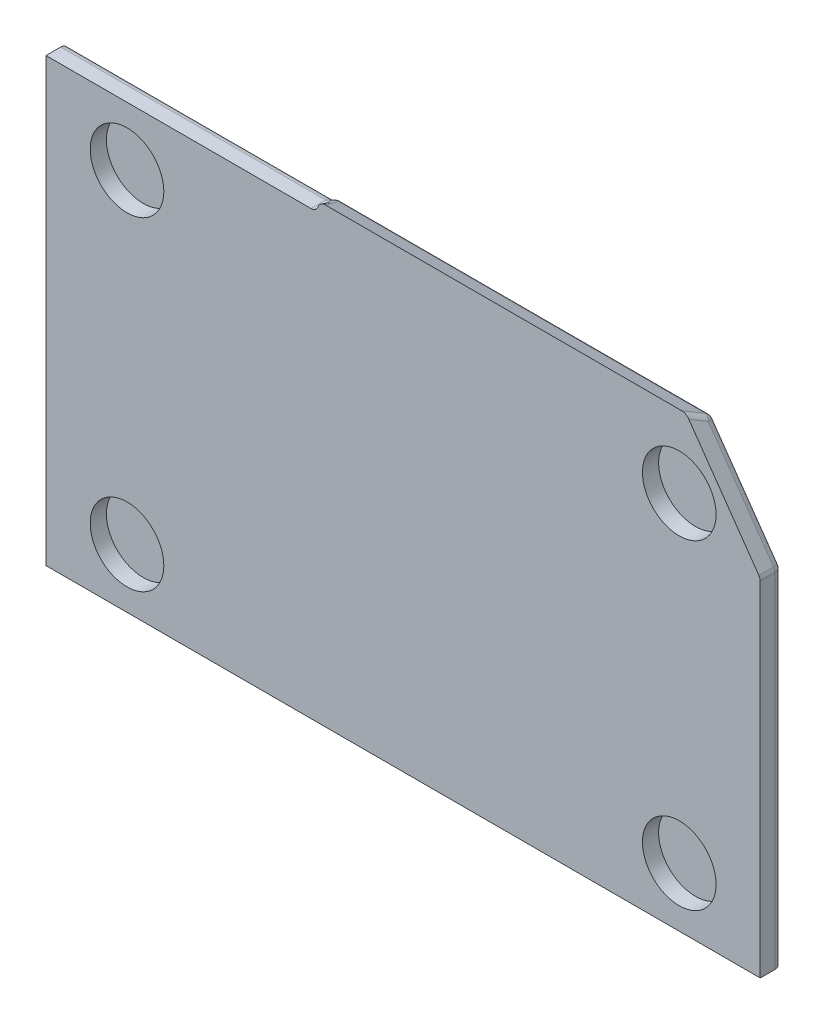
ISO-10303-21;
HEADER;
FILE_DESCRIPTION(('STEP AP214'),'2;1');
FILE_NAME('part.step','',(''),(''),'','','');
FILE_SCHEMA(('AUTOMOTIVE_DESIGN { 1 0 10303 214 1 1 1 1 }'));
ENDSEC;
DATA;
#1=APPLICATION_CONTEXT('core data for automotive mechanical design processes');
#2=APPLICATION_PROTOCOL_DEFINITION('international standard','automotive_design',2000,#1);
#3=PRODUCT_CONTEXT('',#1,'mechanical');
#4=PRODUCT('Part','Part','',(#3));
#5=PRODUCT_RELATED_PRODUCT_CATEGORY('part','',(#4));
#6=PRODUCT_DEFINITION_FORMATION('','',#4);
#7=PRODUCT_DEFINITION_CONTEXT('part definition',#1,'design');
#8=PRODUCT_DEFINITION('design','',#6,#7);
#9=PRODUCT_DEFINITION_SHAPE('','',#8);
#10=(LENGTH_UNIT() NAMED_UNIT(*) SI_UNIT(.MILLI.,.METRE.));
#11=(NAMED_UNIT(*) PLANE_ANGLE_UNIT() SI_UNIT($,.RADIAN.));
#12=(NAMED_UNIT(*) SI_UNIT($,.STERADIAN.) SOLID_ANGLE_UNIT());
#13=UNCERTAINTY_MEASURE_WITH_UNIT(LENGTH_MEASURE(1.E-05),#10,'distance_accuracy_value','');
#14=(GEOMETRIC_REPRESENTATION_CONTEXT(3) GLOBAL_UNCERTAINTY_ASSIGNED_CONTEXT((#13)) GLOBAL_UNIT_ASSIGNED_CONTEXT((#10,
#11,#12)) REPRESENTATION_CONTEXT('',''));
#15=CARTESIAN_POINT('',(0.,0.,0.));
#16=DIRECTION('',(0.,0.,1.));
#17=DIRECTION('',(1.,0.,0.));
#18=AXIS2_PLACEMENT_3D('',#15,#16,#17);
#19=CARTESIAN_POINT('',(97.,0.,3.));
#20=DIRECTION('',(0.,1.,0.));
#21=DIRECTION('',(0.,0.,1.));
#22=AXIS2_PLACEMENT_3D('',#19,#20,#21);
#23=PLANE('',#22);
#24=DIRECTION('',(1.,0.,0.));
#25=VECTOR('',#24,1.);
#26=CARTESIAN_POINT('',(97.,0.,0.));
#27=LINE('',#26,#25);
#28=CARTESIAN_POINT('',(0.,0.,0.));
#29=VERTEX_POINT('',#28);
#30=CARTESIAN_POINT('',(96.,0.,0.));
#31=VERTEX_POINT('',#30);
#32=EDGE_CURVE('E342',#29,#31,#27,.T.);
#33=ORIENTED_EDGE('',*,*,#32,.T.);
#34=CARTESIAN_POINT('',(96.,0.,1.));
#35=DIRECTION('',(0.,1.,0.));
#36=DIRECTION('',(0.,0.,1.));
#37=AXIS2_PLACEMENT_3D('',#34,#35,#36);
#38=CIRCLE('',#37,1.);
#39=CARTESIAN_POINT('',(97.,0.,1.));
#40=VERTEX_POINT('',#39);
#41=EDGE_CURVE('E73',#31,#40,#38,.F.);
#42=ORIENTED_EDGE('',*,*,#41,.T.);
#43=DIRECTION('',(0.,0.,-1.));
#44=VECTOR('',#43,1.);
#45=CARTESIAN_POINT('',(97.,0.,3.));
#46=LINE('',#45,#44);
#47=CARTESIAN_POINT('',(97.,0.,3.));
#48=VERTEX_POINT('',#47);
#49=EDGE_CURVE('E147',#48,#40,#46,.T.);
#50=ORIENTED_EDGE('',*,*,#49,.F.);
#51=DIRECTION('',(1.,0.,0.));
#52=VECTOR('',#51,1.);
#53=CARTESIAN_POINT('',(97.,0.,3.));
#54=LINE('',#53,#52);
#55=CARTESIAN_POINT('',(0.,0.,3.));
#56=VERTEX_POINT('',#55);
#57=EDGE_CURVE('E153',#56,#48,#54,.T.);
#58=ORIENTED_EDGE('',*,*,#57,.F.);
#59=DIRECTION('',(0.,0.,-1.));
#60=VECTOR('',#59,1.);
#61=CARTESIAN_POINT('',(0.,0.,3.));
#62=LINE('',#61,#60);
#63=EDGE_CURVE('E175',#56,#29,#62,.T.);
#64=ORIENTED_EDGE('',*,*,#63,.T.);
#65=EDGE_LOOP('',(#33,#42,#50,#58,#64));
#66=FACE_BOUND('',#65,.T.);
#67=ADVANCED_FACE('F47',(#66),#23,.F.);
#68=CARTESIAN_POINT('',(97.,47.,3.));
#69=DIRECTION('',(-1.,0.,0.));
#70=DIRECTION('',(0.,0.,1.));
#71=AXIS2_PLACEMENT_3D('',#68,#69,#70);
#72=PLANE('',#71);
#73=ORIENTED_EDGE('',*,*,#49,.T.);
#74=DIRECTION('',(0.,1.,0.));
#75=VECTOR('',#74,1.);
#76=CARTESIAN_POINT('',(97.,47.,1.));
#77=LINE('',#76,#75);
#78=CARTESIAN_POINT('',(97.,46.6848546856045,1.));
#79=VERTEX_POINT('',#78);
#80=EDGE_CURVE('E65',#40,#79,#77,.T.);
#81=ORIENTED_EDGE('',*,*,#80,.T.);
#82=DIRECTION('',(0.,0.,-1.));
#83=VECTOR('',#82,1.);
#84=CARTESIAN_POINT('',(97.,46.6848546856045,3.));
#85=LINE('',#84,#83);
#86=CARTESIAN_POINT('',(97.,46.6848546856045,3.));
#87=VERTEX_POINT('',#86);
#88=EDGE_CURVE('E148',#79,#87,#85,.F.);
#89=ORIENTED_EDGE('',*,*,#88,.T.);
#90=DIRECTION('',(0.,1.,0.));
#91=VECTOR('',#90,1.);
#92=CARTESIAN_POINT('',(97.,47.,3.));
#93=LINE('',#92,#91);
#94=EDGE_CURVE('E144',#48,#87,#93,.T.);
#95=ORIENTED_EDGE('',*,*,#94,.F.);
#96=EDGE_LOOP('',(#73,#81,#89,#95));
#97=FACE_BOUND('',#96,.T.);
#98=ADVANCED_FACE('F146',(#97),#72,.F.);
#99=CARTESIAN_POINT('',(86.93,61.39,3.));
#100=DIRECTION('',(-0.819312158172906,-0.573347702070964,0.));
#101=DIRECTION('',(0.573347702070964,-0.819312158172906,0.));
#102=AXIS2_PLACEMENT_3D('',#99,#100,#101);
#103=PLANE('',#102);
#104=DIRECTION('',(-0.573347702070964,0.819312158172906,0.));
#105=VECTOR('',#104,1.);
#106=CARTESIAN_POINT('',(87.9027102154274,60.,1.));
#107=LINE('',#106,#105);
#108=CARTESIAN_POINT('',(96.8193121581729,47.2582023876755,1.));
#109=VERTEX_POINT('',#108);
#110=CARTESIAN_POINT('',(87.9485067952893,59.9345568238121,1.));
#111=VERTEX_POINT('',#110);
#112=EDGE_CURVE('E283',#109,#111,#107,.T.);
#113=ORIENTED_EDGE('',*,*,#112,.T.);
#114=DIRECTION('',(-0.282232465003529,0.403309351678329,0.870451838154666));
#115=VECTOR('',#114,1.);
#116=CARTESIAN_POINT('',(87.2103692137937,60.9893532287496,3.27653900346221));
#117=LINE('',#116,#115);
#118=CARTESIAN_POINT('',(87.3000333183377,60.8612234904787,3.));
#119=VERTEX_POINT('',#118);
#120=EDGE_CURVE('E286',#111,#119,#117,.T.);
#121=ORIENTED_EDGE('',*,*,#120,.T.);
#122=DIRECTION('',(-0.573347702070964,0.819312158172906,0.));
#123=VECTOR('',#122,1.);
#124=CARTESIAN_POINT('',(86.93,61.39,3.));
#125=LINE('',#124,#123);
#126=CARTESIAN_POINT('',(96.8193121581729,47.2582023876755,3.));
#127=VERTEX_POINT('',#126);
#128=EDGE_CURVE('E152',#127,#119,#125,.T.);
#129=ORIENTED_EDGE('',*,*,#128,.F.);
#130=DIRECTION('',(0.,0.,-1.));
#131=VECTOR('',#130,1.);
#132=CARTESIAN_POINT('',(96.8193121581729,47.2582023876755,3.));
#133=LINE('',#132,#131);
#134=EDGE_CURVE('E280',#127,#109,#133,.T.);
#135=ORIENTED_EDGE('',*,*,#134,.T.);
#136=EDGE_LOOP('',(#113,#121,#129,#135));
#137=FACE_BOUND('',#136,.T.);
#138=ADVANCED_FACE('F219',(#137),#103,.F.);
#139=CARTESIAN_POINT('',(0.,60.,3.));
#140=DIRECTION('',(0.,-1.,0.));
#141=DIRECTION('',(0.,0.,-1.));
#142=AXIS2_PLACEMENT_3D('',#139,#140,#141);
#143=PLANE('',#142);
#144=DIRECTION('',(0.,0.,-1.));
#145=VECTOR('',#144,1.);
#146=CARTESIAN_POINT('',(36.,60.,0.));
#147=LINE('',#146,#145);
#148=CARTESIAN_POINT('',(36.,60.,3.));
#149=VERTEX_POINT('',#148);
#150=CARTESIAN_POINT('',(36.,60.,1.));
#151=VERTEX_POINT('',#150);
#152=EDGE_CURVE('E166',#149,#151,#147,.T.);
#153=ORIENTED_EDGE('',*,*,#152,.T.);
#154=DIRECTION('',(-1.,0.,0.));
#155=VECTOR('',#154,1.);
#156=CARTESIAN_POINT('',(0.,60.,1.));
#157=LINE('',#156,#155);
#158=CARTESIAN_POINT('',(0.,60.,1.));
#159=VERTEX_POINT('',#158);
#160=EDGE_CURVE('E248',#151,#159,#157,.T.);
#161=ORIENTED_EDGE('',*,*,#160,.T.);
#162=DIRECTION('',(0.,0.,-1.));
#163=VECTOR('',#162,1.);
#164=CARTESIAN_POINT('',(0.,60.,3.));
#165=LINE('',#164,#163);
#166=CARTESIAN_POINT('',(0.,60.,3.));
#167=VERTEX_POINT('',#166);
#168=EDGE_CURVE('E167',#167,#159,#165,.T.);
#169=ORIENTED_EDGE('',*,*,#168,.F.);
#170=DIRECTION('',(-1.,0.,0.));
#171=VECTOR('',#170,1.);
#172=CARTESIAN_POINT('',(0.,60.,3.));
#173=LINE('',#172,#171);
#174=EDGE_CURVE('E353',#149,#167,#173,.T.);
#175=ORIENTED_EDGE('',*,*,#174,.F.);
#176=EDGE_LOOP('',(#153,#161,#169,#175));
#177=FACE_BOUND('',#176,.T.);
#178=ADVANCED_FACE('F215',(#177),#143,.F.);
#179=CARTESIAN_POINT('',(0.,0.,3.));
#180=DIRECTION('',(1.,0.,0.));
#181=DIRECTION('',(0.,0.,-1.));
#182=AXIS2_PLACEMENT_3D('',#179,#180,#181);
#183=PLANE('',#182);
#184=ORIENTED_EDGE('',*,*,#168,.T.);
#185=CARTESIAN_POINT('',(0.,59.,1.));
#186=DIRECTION('',(1.,0.,0.));
#187=DIRECTION('',(0.,0.,-1.));
#188=AXIS2_PLACEMENT_3D('',#185,#186,#187);
#189=CIRCLE('',#188,1.);
#190=CARTESIAN_POINT('',(0.,59.,0.));
#191=VERTEX_POINT('',#190);
#192=EDGE_CURVE('E371',#159,#191,#189,.F.);
#193=ORIENTED_EDGE('',*,*,#192,.T.);
#194=DIRECTION('',(0.,-1.,0.));
#195=VECTOR('',#194,1.);
#196=CARTESIAN_POINT('',(0.,0.,0.));
#197=LINE('',#196,#195);
#198=EDGE_CURVE('E163',#191,#29,#197,.T.);
#199=ORIENTED_EDGE('',*,*,#198,.T.);
#200=ORIENTED_EDGE('',*,*,#63,.F.);
#201=DIRECTION('',(0.,-1.,0.));
#202=VECTOR('',#201,1.);
#203=CARTESIAN_POINT('',(0.,0.,3.));
#204=LINE('',#203,#202);
#205=EDGE_CURVE('E159',#167,#56,#204,.T.);
#206=ORIENTED_EDGE('',*,*,#205,.F.);
#207=EDGE_LOOP('',(#184,#193,#199,#200,#206));
#208=FACE_BOUND('',#207,.T.);
#209=ADVANCED_FACE('F206',(#208),#183,.F.);
#210=CARTESIAN_POINT('',(0.,0.,3.));
#211=DIRECTION('',(0.,0.,-1.));
#212=DIRECTION('',(-1.,0.,0.));
#213=AXIS2_PLACEMENT_3D('',#210,#211,#212);
#214=PLANE('',#213);
#215=CARTESIAN_POINT('',(11.,8.,3.));
#216=DIRECTION('',(0.,0.,1.));
#217=DIRECTION('',(1.,0.,0.));
#218=AXIS2_PLACEMENT_3D('',#215,#216,#217);
#219=CIRCLE('',#218,5.);
#220=CARTESIAN_POINT('',(16.,8.,3.));
#221=VERTEX_POINT('',#220);
#222=EDGE_CURVE('E328',#221,#221,#219,.T.);
#223=ORIENTED_EDGE('',*,*,#222,.F.);
#224=EDGE_LOOP('',(#223));
#225=FACE_BOUND('',#224,.T.);
#226=CARTESIAN_POINT('',(86.,8.,3.));
#227=DIRECTION('',(0.,0.,1.));
#228=DIRECTION('',(1.,0.,0.));
#229=AXIS2_PLACEMENT_3D('',#226,#227,#228);
#230=CIRCLE('',#229,5.);
#231=CARTESIAN_POINT('',(91.,8.,3.));
#232=VERTEX_POINT('',#231);
#233=EDGE_CURVE('E640',#232,#232,#230,.T.);
#234=ORIENTED_EDGE('',*,*,#233,.F.);
#235=EDGE_LOOP('',(#234));
#236=FACE_BOUND('',#235,.T.);
#237=CARTESIAN_POINT('',(86.,51.5,3.));
#238=DIRECTION('',(0.,0.,1.));
#239=DIRECTION('',(1.,0.,0.));
#240=AXIS2_PLACEMENT_3D('',#237,#238,#239);
#241=CIRCLE('',#240,5.00000000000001);
#242=CARTESIAN_POINT('',(91.,51.5,3.));
#243=VERTEX_POINT('',#242);
#244=EDGE_CURVE('E346',#243,#243,#241,.T.);
#245=ORIENTED_EDGE('',*,*,#244,.F.);
#246=EDGE_LOOP('',(#245));
#247=FACE_BOUND('',#246,.T.);
#248=CARTESIAN_POINT('',(11.,52.,3.));
#249=DIRECTION('',(0.,0.,1.));
#250=DIRECTION('',(1.,0.,0.));
#251=AXIS2_PLACEMENT_3D('',#248,#249,#250);
#252=CIRCLE('',#251,5.);
#253=CARTESIAN_POINT('',(16.,52.,3.));
#254=VERTEX_POINT('',#253);
#255=EDGE_CURVE('E343',#254,#254,#252,.T.);
#256=ORIENTED_EDGE('',*,*,#255,.F.);
#257=EDGE_LOOP('',(#256));
#258=FACE_BOUND('',#257,.T.);
#259=ORIENTED_EDGE('',*,*,#128,.T.);
#260=CARTESIAN_POINT('',(86.4807211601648,60.2878757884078,3.));
#261=DIRECTION('',(0.,0.,-1.));
#262=DIRECTION('',(-0.573347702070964,0.819312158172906,0.));
#263=AXIS2_PLACEMENT_3D('',#260,#261,#262);
#264=ELLIPSE('',#263,1.14882863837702,1.);
#265=CARTESIAN_POINT('',(86.3444119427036,61.39,3.));
#266=VERTEX_POINT('',#265);
#267=EDGE_CURVE('E11',#119,#266,#264,.F.);
#268=ORIENTED_EDGE('',*,*,#267,.T.);
#269=DIRECTION('',(-1.,0.,0.));
#270=VECTOR('',#269,1.);
#271=CARTESIAN_POINT('',(37.,61.39,3.));
#272=LINE('',#271,#270);
#273=CARTESIAN_POINT('',(37.9319318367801,61.39,3.));
#274=VERTEX_POINT('',#273);
#275=EDGE_CURVE('E350',#266,#274,#272,.T.);
#276=ORIENTED_EDGE('',*,*,#275,.T.);
#277=CARTESIAN_POINT('',(35.0027521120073,60.9258606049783,4.21693256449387));
#278=CARTESIAN_POINT('',(34.9762184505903,61.2827644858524,4.05065311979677));
#279=CARTESIAN_POINT('',(34.6880803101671,61.5235035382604,3.92918547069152));
#280=CARTESIAN_POINT('',(34.3999421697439,61.7642425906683,3.80771782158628));
#281=CARTESIAN_POINT('',(34.0055042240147,61.7590599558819,3.79653227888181));
#282=CARTESIAN_POINT('',(35.0047346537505,60.899259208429,4.10210639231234));
#283=CARTESIAN_POINT('',(34.9691770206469,61.249087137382,3.93876588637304));
#284=CARTESIAN_POINT('',(34.682970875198,61.4809109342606,3.8176116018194));
#285=CARTESIAN_POINT('',(34.3967878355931,61.7129374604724,3.6969873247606));
#286=CARTESIAN_POINT('',(34.0094693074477,61.7058571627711,3.68170610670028));
#287=CARTESIAN_POINT('',(35.0077761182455,60.8726727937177,3.98734488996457));
#288=CARTESIAN_POINT('',(34.9636923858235,61.2149724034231,3.82652010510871));
#289=CARTESIAN_POINT('',(34.6796959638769,61.4381136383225,3.7059379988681));
#290=CARTESIAN_POINT('',(34.3957055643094,61.6614506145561,3.58586463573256));
#291=CARTESIAN_POINT('',(34.0155522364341,61.65268433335,3.56694460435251));
#292=CARTESIAN_POINT('',(35.0160467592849,60.8195545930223,3.75805769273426));
#293=CARTESIAN_POINT('',(34.9559986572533,61.1461439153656,3.60203151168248));
#294=CARTESIAN_POINT('',(34.6769192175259,61.3521980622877,3.4825396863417));
#295=CARTESIAN_POINT('',(34.3978463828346,61.5584472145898,3.36355513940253));
#296=CARTESIAN_POINT('',(34.032093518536,61.5464479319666,3.3376574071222));
#297=CARTESIAN_POINT('',(35.0212764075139,60.7930228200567,3.64353205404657));
#298=CARTESIAN_POINT('',(34.9537747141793,61.1114263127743,3.48976770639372));
#299=CARTESIAN_POINT('',(34.6774181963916,61.3090797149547,3.37081497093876));
#300=CARTESIAN_POINT('',(34.4010510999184,61.5069211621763,3.2523478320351));
#301=CARTESIAN_POINT('',(34.0425528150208,61.4933843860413,3.22313176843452));
#302=CARTESIAN_POINT('',(35.0403289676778,60.7136535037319,3.30093068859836));
#303=CARTESIAN_POINT('',(34.9521737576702,61.0069004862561,3.15437549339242));
#304=CARTESIAN_POINT('',(34.6847259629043,61.1795500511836,3.0362377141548));
#305=CARTESIAN_POINT('',(34.417236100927,61.3529441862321,2.92002342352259));
#306=CARTESIAN_POINT('',(34.0806579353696,61.3346457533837,2.88053040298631));
#307=CARTESIAN_POINT('',(35.0575217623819,60.660951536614,3.07344018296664));
#308=CARTESIAN_POINT('',(34.9577494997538,60.9361284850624,2.93069494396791));
#309=CARTESIAN_POINT('',(34.6973275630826,61.0928189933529,2.81360248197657));
#310=CARTESIAN_POINT('',(34.4367387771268,61.2501994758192,2.69827224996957));
#311=CARTESIAN_POINT('',(34.1150435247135,61.2292418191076,2.65303989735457));
#312=CARTESIAN_POINT('',(35.1024608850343,60.5552513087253,2.6171802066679));
#313=CARTESIAN_POINT('',(34.9841893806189,60.7922731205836,2.48165269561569));
#314=CARTESIAN_POINT('',(34.7401274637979,60.9177071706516,2.36637812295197));
#315=CARTESIAN_POINT('',(34.4958904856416,61.0438500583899,2.25291379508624));
#316=CARTESIAN_POINT('',(34.20492177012,61.0178413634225,2.19677992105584));
#317=CARTESIAN_POINT('',(35.1304068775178,60.5022673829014,2.38847261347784));
#318=CARTESIAN_POINT('',(35.0052368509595,60.7191220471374,2.25614326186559));
#319=CARTESIAN_POINT('',(34.7706648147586,60.8293272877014,2.14183583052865));
#320=CARTESIAN_POINT('',(34.5357880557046,60.9401764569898,2.02915782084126));
#321=CARTESIAN_POINT('',(34.2608137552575,60.9118735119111,1.96807232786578));
#322=CARTESIAN_POINT('',(35.1820780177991,60.4238231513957,2.04986441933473));
#323=CARTESIAN_POINT('',(35.0510575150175,60.6094337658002,1.92144584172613));
#324=CARTESIAN_POINT('',(34.8327140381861,60.6977619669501,1.80899164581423));
#325=CARTESIAN_POINT('',(34.6142946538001,60.7862522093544,1.69694721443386));
#326=CARTESIAN_POINT('',(34.3641560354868,60.7549850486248,1.62946413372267));
#327=CARTESIAN_POINT('',(35.2009733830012,60.3977974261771,1.93752315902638));
#328=CARTESIAN_POINT('',(35.0686897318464,60.5728972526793,1.81053316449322));
#329=CARTESIAN_POINT('',(34.8561658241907,60.6539901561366,1.69849417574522));
#330=CARTESIAN_POINT('',(34.643548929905,60.7352354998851,1.58683920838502));
#331=CARTESIAN_POINT('',(34.4019467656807,60.7029335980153,1.51712287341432));
#332=CARTESIAN_POINT('',(35.2425360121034,60.3462817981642,1.71515354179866));
#333=CARTESIAN_POINT('',(35.1093568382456,60.50021492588,1.59091506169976));
#334=CARTESIAN_POINT('',(34.9092949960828,60.5671325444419,1.47965697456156));
#335=CARTESIAN_POINT('',(34.7091403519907,60.6342014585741,1.36878012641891));
#336=CARTESIAN_POINT('',(34.4850720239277,60.5999023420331,1.2947532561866));
#337=CARTESIAN_POINT('',(35.2652022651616,60.3207917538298,1.60512457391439));
#338=CARTESIAN_POINT('',(35.1323748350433,60.4640616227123,1.4821831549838));
#339=CARTESIAN_POINT('',(34.938970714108,60.5240465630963,1.37131667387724));
#340=CARTESIAN_POINT('',(34.7454563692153,60.5841720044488,1.26080288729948));
#341=CARTESIAN_POINT('',(34.5304045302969,60.5489222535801,1.18472428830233));
#342=CARTESIAN_POINT('',(35.3105493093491,60.2750868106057,1.40783704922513));
#343=CARTESIAN_POINT('',(35.1800568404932,60.3989298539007,1.28711197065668));
#344=CARTESIAN_POINT('',(34.9996586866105,60.4466195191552,1.1769665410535));
#345=CARTESIAN_POINT('',(34.8191865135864,60.4944037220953,1.06705839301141));
#346=CARTESIAN_POINT('',(34.6210986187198,60.4575123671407,0.98743676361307));
#347=CARTESIAN_POINT('',(35.332500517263,60.2547447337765,1.32002952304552));
#348=CARTESIAN_POINT('',(35.2036664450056,60.3698360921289,1.2002781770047));
#349=CARTESIAN_POINT('',(35.0294797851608,60.4120942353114,1.090432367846));
#350=CARTESIAN_POINT('',(34.8552091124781,60.4544396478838,0.98080499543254));
#351=CARTESIAN_POINT('',(34.6650010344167,60.4168282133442,0.899629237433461));
#352=CARTESIAN_POINT('',(35.379992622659,60.2147892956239,1.14756000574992));
#353=CARTESIAN_POINT('',(35.2558856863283,60.3125021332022,1.02969018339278));
#354=CARTESIAN_POINT('',(35.0949234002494,60.3441679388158,0.920406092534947));
#355=CARTESIAN_POINT('',(34.9338773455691,60.3759206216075,0.811339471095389));
#356=CARTESIAN_POINT('',(34.7599852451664,60.3369173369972,0.727159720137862));
#357=CARTESIAN_POINT('',(35.4055354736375,60.1951763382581,1.06289975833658));
#358=CARTESIAN_POINT('',(35.2844891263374,60.2842559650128,0.945917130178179));
#359=CARTESIAN_POINT('',(35.1305490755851,60.3107675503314,0.836915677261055));
#360=CARTESIAN_POINT('',(34.9765154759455,60.3373570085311,0.728108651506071));
#361=CARTESIAN_POINT('',(34.8110709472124,60.2976914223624,0.64249947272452));
#362=CARTESIAN_POINT('',(35.4611030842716,60.1569486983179,0.897888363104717));
#363=CARTESIAN_POINT('',(35.3478297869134,60.2290414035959,0.782617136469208));
#364=CARTESIAN_POINT('',(35.2089527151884,60.2455701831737,0.674135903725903));
#365=CARTESIAN_POINT('',(35.069981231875,60.2621773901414,0.565850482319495));
#366=CARTESIAN_POINT('',(34.9222061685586,60.2212361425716,0.477488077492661));
#367=CARTESIAN_POINT('',(35.4911506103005,60.1383397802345,0.817562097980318));
#368=CARTESIAN_POINT('',(35.3825901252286,60.2020716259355,0.703087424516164));
#369=CARTESIAN_POINT('',(35.2517671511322,60.2137825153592,0.594870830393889));
#370=CARTESIAN_POINT('',(35.1208405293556,60.2255600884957,0.48682033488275));
#371=CARTESIAN_POINT('',(34.9823012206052,60.1840183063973,0.397161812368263));
#372=CARTESIAN_POINT('',(35.5566981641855,60.102851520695,0.664375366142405));
#373=CARTESIAN_POINT('',(35.4595170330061,60.1505110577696,0.551414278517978));
#374=CARTESIAN_POINT('',(35.3460486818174,60.1530830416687,0.443669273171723));
#375=CARTESIAN_POINT('',(35.2324785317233,60.1557206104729,0.336087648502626));
#376=CARTESIAN_POINT('',(35.1133963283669,60.1130417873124,0.243975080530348));
#377=CARTESIAN_POINT('',(35.5921950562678,60.0859711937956,0.59151064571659));
#378=CARTESIAN_POINT('',(35.5016726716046,60.1259074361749,0.479232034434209));
#379=CARTESIAN_POINT('',(35.3975108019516,60.1241695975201,0.371728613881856));
#380=CARTESIAN_POINT('',(35.2932436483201,60.1224805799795,0.264346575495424));
#381=CARTESIAN_POINT('',(35.1843901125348,60.0792811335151,0.17111036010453));
#382=CARTESIAN_POINT('',(35.6589064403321,60.0594953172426,0.477226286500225));
#383=CARTESIAN_POINT('',(35.5818011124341,60.0872374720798,0.366003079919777));
#384=CARTESIAN_POINT('',(35.4949367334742,60.0787735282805,0.258871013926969));
#385=CARTESIAN_POINT('',(35.4080179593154,60.0703350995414,0.151802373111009));
#386=CARTESIAN_POINT('',(35.3178128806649,60.0263293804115,0.0568260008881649));
#387=CARTESIAN_POINT('',(35.6884965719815,60.0491891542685,0.432739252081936));
#388=CARTESIAN_POINT('',(35.6175749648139,60.0721581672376,0.321921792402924));
#389=CARTESIAN_POINT('',(35.5383449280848,60.0610869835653,0.214931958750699));
#390=CARTESIAN_POINT('',(35.4590635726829,60.0500331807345,0.107985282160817));
#391=CARTESIAN_POINT('',(35.3769931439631,60.0057170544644,0.0123389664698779));
#392=CARTESIAN_POINT('',(35.751435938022,60.0308305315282,0.353493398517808));
#393=CARTESIAN_POINT('',(35.6941218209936,60.0452709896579,0.243409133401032));
#394=CARTESIAN_POINT('',(35.6310438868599,60.029563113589,0.136653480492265));
#395=CARTESIAN_POINT('',(35.5679158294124,60.0138723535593,0.0299403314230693));
#396=CARTESIAN_POINT('',(35.5028718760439,59.9689998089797,-0.0669068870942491));
#397=CARTESIAN_POINT('',(35.784778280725,60.0227740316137,0.318717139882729));
#398=CARTESIAN_POINT('',(35.7348905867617,60.0334500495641,0.208939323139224));
#399=CARTESIAN_POINT('',(35.68032387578,60.0157188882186,0.102296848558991));
#400=CARTESIAN_POINT('',(35.625717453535,59.9979957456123,-0.00432572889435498));
#401=CARTESIAN_POINT('',(35.5695565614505,59.9528868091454,-0.101683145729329));
#402=CARTESIAN_POINT('',(35.8534586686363,60.010215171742,0.264506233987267));
#403=CARTESIAN_POINT('',(35.8191975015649,60.0150160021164,0.155220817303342));
#404=CARTESIAN_POINT('',(35.7821041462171,59.9941303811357,0.0487365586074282));
#405=CARTESIAN_POINT('',(35.7449749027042,59.9732527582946,-0.0577278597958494));
#406=CARTESIAN_POINT('',(35.7069173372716,59.9277690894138,-0.15589405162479));
#407=CARTESIAN_POINT('',(35.8886399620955,60.0055695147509,0.244453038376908));
#408=CARTESIAN_POINT('',(35.8625396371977,60.0081867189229,0.135340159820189));
#409=CARTESIAN_POINT('',(35.83436060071,59.9861401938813,0.0289219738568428));
#410=CARTESIAN_POINT('',(35.8061651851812,59.9640953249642,-0.0774921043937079));
#411=CARTESIAN_POINT('',(35.7772799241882,59.9184777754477,-0.175947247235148));
#412=CARTESIAN_POINT('',(35.9425569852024,60.0014869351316,0.226830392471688));
#413=CARTESIAN_POINT('',(35.9290629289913,60.0021859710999,0.117874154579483));
#414=CARTESIAN_POINT('',(35.9145320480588,59.9791178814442,0.0115087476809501));
#415=CARTESIAN_POINT('',(35.8999965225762,59.9560500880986,-0.0948559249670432));
#416=CARTESIAN_POINT('',(35.8851139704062,59.9103126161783,-0.193569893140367));
#417=CARTESIAN_POINT('',(35.9607037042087,60.0006065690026,0.223030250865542));
#418=CARTESIAN_POINT('',(35.9514696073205,60.0008917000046,0.114107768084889));
#419=CARTESIAN_POINT('',(35.9415291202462,59.977603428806,0.00775368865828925));
#420=CARTESIAN_POINT('',(35.9315872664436,59.9543151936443,-0.0986003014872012));
#421=CARTESIAN_POINT('',(35.9214074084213,59.9085518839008,-0.197370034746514));
#422=CARTESIAN_POINT('',(35.9971143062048,59.9998383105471,0.219714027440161));
#423=CARTESIAN_POINT('',(35.996434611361,59.999762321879,0.1108212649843));
#424=CARTESIAN_POINT('',(35.9957052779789,59.9762818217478,0.00447680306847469));
#425=CARTESIAN_POINT('',(35.9949748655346,59.9528013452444,-0.101867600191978));
#426=CARTESIAN_POINT('',(35.9942286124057,59.907015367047,-0.200686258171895));
#427=CARTESIAN_POINT('',(36.015378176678,59.9999503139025,0.220197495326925));
#428=CARTESIAN_POINT('',(36.018995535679,59.9999269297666,0.111300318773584));
#429=CARTESIAN_POINT('',(36.0228843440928,59.9764744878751,0.00495453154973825));
#430=CARTESIAN_POINT('',(36.0267753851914,59.9530220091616,-0.101391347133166));
#431=CARTESIAN_POINT('',(36.0307563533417,59.9072393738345,-0.200202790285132));
#432=CARTESIAN_POINT('',(36.0680942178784,60.0017275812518,0.227869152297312));
#433=CARTESIAN_POINT('',(36.0840891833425,60.002539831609,0.118903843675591));
#434=CARTESIAN_POINT('',(36.1013143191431,59.9795318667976,0.0125351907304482));
#435=CARTESIAN_POINT('',(36.1185459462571,59.95652439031,-0.0938322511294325));
#436=CARTESIAN_POINT('',(36.1361884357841,59.9107939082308,-0.192531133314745));
#437=CARTESIAN_POINT('',(36.1023322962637,60.0046992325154,0.240696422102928));
#438=CARTESIAN_POINT('',(36.1263444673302,60.0069100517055,0.131620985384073));
#439=CARTESIAN_POINT('',(36.1522299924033,59.9846439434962,0.025210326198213));
#440=CARTESIAN_POINT('',(36.178141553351,59.9623822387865,-0.0811894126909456));
#441=CARTESIAN_POINT('',(36.2046645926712,59.9167372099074,-0.17970386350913));
#442=CARTESIAN_POINT('',(36.1684580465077,60.0137173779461,0.27962366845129));
#443=CARTESIAN_POINT('',(36.2077334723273,60.0201555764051,0.170195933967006));
#444=CARTESIAN_POINT('',(36.2504010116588,60.0001510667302,0.0636727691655));
#445=CARTESIAN_POINT('',(36.2930947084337,59.9801503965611,-0.0428408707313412));
#446=CARTESIAN_POINT('',(36.3369160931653,59.9347735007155,-0.140776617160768));
#447=CARTESIAN_POINT('',(36.200334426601,60.0197776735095,0.305783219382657));
#448=CARTESIAN_POINT('',(36.246865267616,60.0290559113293,0.196126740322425));
#449=CARTESIAN_POINT('',(36.2976388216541,60.0105698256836,0.0895189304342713));
#450=CARTESIAN_POINT('',(36.3484504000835,59.9920943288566,-0.017062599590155));
#451=CARTESIAN_POINT('',(36.4006688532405,59.946894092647,-0.1146170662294));
#452=CARTESIAN_POINT('',(36.2624369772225,60.0344975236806,0.369322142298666));
#453=CARTESIAN_POINT('',(36.3227862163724,60.0506409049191,0.259084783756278));
#454=CARTESIAN_POINT('',(36.3894200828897,60.0358608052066,0.152289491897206));
#455=CARTESIAN_POINT('',(36.4560961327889,60.0210922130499,0.0455227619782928));
#456=CARTESIAN_POINT('',(36.5248739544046,59.9763337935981,-0.0510781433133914));
#457=CARTESIAN_POINT('',(36.2925095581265,60.0432682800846,0.407181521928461));
#458=CARTESIAN_POINT('',(36.3593773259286,60.0634932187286,0.296603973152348));
#459=CARTESIAN_POINT('',(36.4337239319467,60.0509234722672,0.18968780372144));
#460=CARTESIAN_POINT('',(36.5081182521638,60.0383727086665,0.0828187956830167));
#461=CARTESIAN_POINT('',(36.5850191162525,59.9938753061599,-0.0132187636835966));
#462=CARTESIAN_POINT('',(36.349294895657,60.0625070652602,0.490226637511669));
#463=CARTESIAN_POINT('',(36.4280772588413,60.0916343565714,0.3788724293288));
#464=CARTESIAN_POINT('',(36.5170668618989,60.0839386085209,0.271709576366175));
#465=CARTESIAN_POINT('',(36.6061047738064,60.0762619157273,0.164594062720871));
#466=CARTESIAN_POINT('',(36.6985897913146,60.0323528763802,0.0698263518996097));
#467=CARTESIAN_POINT('',(36.3760086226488,60.0729746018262,0.535410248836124));
#468=CARTESIAN_POINT('',(36.460189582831,60.1069283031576,0.423636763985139));
#469=CARTESIAN_POINT('',(36.5561074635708,60.1018902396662,0.316330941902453));
#470=CARTESIAN_POINT('',(36.652074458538,60.0968775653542,0.209088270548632));
#471=CARTESIAN_POINT('',(36.7520172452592,60.0532879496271,0.115009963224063));
#472=CARTESIAN_POINT('',(36.430703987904,60.0969335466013,0.638830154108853));
#473=CARTESIAN_POINT('',(36.5254889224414,60.141870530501,0.526075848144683));
#474=CARTESIAN_POINT('',(36.6356724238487,60.142944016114,0.418446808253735));
#475=CARTESIAN_POINT('',(36.745922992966,60.1440520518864,0.310903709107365));
#476=CARTESIAN_POINT('',(36.8614079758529,60.1012058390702,0.218429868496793));
#477=CARTESIAN_POINT('',(36.458150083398,60.1106378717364,0.69798551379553));
#478=CARTESIAN_POINT('',(36.5579474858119,60.1618216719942,0.584665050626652));
#479=CARTESIAN_POINT('',(36.6753523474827,60.1664053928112,0.476846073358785));
#480=CARTESIAN_POINT('',(36.7928217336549,60.1710315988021,0.369132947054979));
#481=CARTESIAN_POINT('',(36.9163001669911,60.1286144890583,0.277585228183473));
#482=CARTESIAN_POINT('',(36.5096455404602,60.1391131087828,0.820900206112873));
#483=CARTESIAN_POINT('',(36.618255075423,60.2031743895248,0.706360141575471));
#484=CARTESIAN_POINT('',(36.7493184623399,60.2150991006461,0.598162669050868));
#485=CARTESIAN_POINT('',(36.8804468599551,60.2270666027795,0.490071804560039));
#486=CARTESIAN_POINT('',(37.0192910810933,60.1855649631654,0.400499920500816));
#487=CARTESIAN_POINT('',(36.5336944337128,60.1538841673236,0.884660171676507));
#488=CARTESIAN_POINT('',(36.646100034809,60.224581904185,0.769483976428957));
#489=CARTESIAN_POINT('',(36.7836039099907,60.2403316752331,0.661080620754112));
#490=CARTESIAN_POINT('',(36.9211683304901,60.2561303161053,0.552799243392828));
#491=CARTESIAN_POINT('',(37.0673888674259,60.2151070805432,0.464259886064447));
#492=CARTESIAN_POINT('',(36.5785821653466,60.1839362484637,1.01438138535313));
#493=CARTESIAN_POINT('',(36.6974697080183,60.2680208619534,0.897866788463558));
#494=CARTESIAN_POINT('',(36.8471042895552,60.2916048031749,0.789057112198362));
#495=CARTESIAN_POINT('',(36.9967976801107,60.3152362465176,0.680365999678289));
#496=CARTESIAN_POINT('',(37.157164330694,60.27521124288,0.59398109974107));
#497=CARTESIAN_POINT('',(36.5994651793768,60.1992057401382,1.0802928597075));
#498=CARTESIAN_POINT('',(36.7210515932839,60.2900423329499,0.963092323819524));
#499=CARTESIAN_POINT('',(36.8763898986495,60.317626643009,0.854067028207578));
#500=CARTESIAN_POINT('',(37.0317822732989,60.3452631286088,0.745172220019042));
#501=CARTESIAN_POINT('',(37.1989303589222,60.3057502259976,0.659892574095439));
#502=CARTESIAN_POINT('',(36.6388694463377,60.2302760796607,1.21440943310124));
#503=CARTESIAN_POINT('',(36.7649454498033,60.3347282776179,1.09577132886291));
#504=CARTESIAN_POINT('',(36.9311528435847,60.3705066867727,0.986313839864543));
#505=CARTESIAN_POINT('',(37.0974144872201,60.4063375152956,0.876987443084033));
#506=CARTESIAN_POINT('',(37.2777388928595,60.3678909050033,0.794009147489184));
#507=CARTESIAN_POINT('',(36.6573898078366,60.24607712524,1.28261538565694));
#508=CARTESIAN_POINT('',(36.7852518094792,60.3573964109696,1.16323641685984));
#509=CARTESIAN_POINT('',(36.9566287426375,60.3973652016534,1.05355156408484));
#510=CARTESIAN_POINT('',(37.1280550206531,60.4373903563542,0.944007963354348));
#511=CARTESIAN_POINT('',(37.3147796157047,60.3994929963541,0.862215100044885));
#512=CARTESIAN_POINT('',(36.6972742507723,60.2825528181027,1.44006441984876));
#513=CARTESIAN_POINT('',(36.8282904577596,60.4095859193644,1.318970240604));
#514=CARTESIAN_POINT('',(37.0109102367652,60.4592793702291,1.20872028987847));
#515=CARTESIAN_POINT('',(37.1936111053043,60.5090652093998,1.09870189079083));
#516=CARTESIAN_POINT('',(37.3945485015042,60.4724443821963,1.0196641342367));
#517=CARTESIAN_POINT('',(36.7179832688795,60.3033536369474,1.52985212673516));
#518=CARTESIAN_POINT('',(36.8500866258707,60.4392354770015,1.40773565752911));
#519=CARTESIAN_POINT('',(37.0386518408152,60.4945251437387,1.29717552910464));
#520=CARTESIAN_POINT('',(37.2272880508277,60.5499140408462,1.18686483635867));
#521=CARTESIAN_POINT('',(37.4359665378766,60.5140460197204,1.1094518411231));
#522=CARTESIAN_POINT('',(36.7565278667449,60.3454184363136,1.71142680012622));
#523=CARTESIAN_POINT('',(36.8896186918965,60.4989497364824,1.58716189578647));
#524=CARTESIAN_POINT('',(37.0894247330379,60.5656617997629,1.47598105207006));
#525=CARTESIAN_POINT('',(37.2893018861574,60.6324737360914,1.36505122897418));
#526=CARTESIAN_POINT('',(37.5130557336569,60.5981756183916,1.29102651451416));
#527=CARTESIAN_POINT('',(36.7743629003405,60.3666825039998,1.80321414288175));
#528=CARTESIAN_POINT('',(36.9073448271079,60.5290193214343,1.67783933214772));
#529=CARTESIAN_POINT('',(37.112455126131,60.6015528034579,1.56633169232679));
#530=CARTESIAN_POINT('',(37.3176265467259,60.6741922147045,1.45509111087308));
#531=CARTESIAN_POINT('',(37.5487258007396,60.6407037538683,1.38281385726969));
#532=CARTESIAN_POINT('',(36.8241933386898,60.4310819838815,2.08119750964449));
#533=CARTESIAN_POINT('',(36.9553073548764,60.6198169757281,1.9527325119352));
#534=CARTESIAN_POINT('',(37.1754365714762,60.7100190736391,1.83983691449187));
#535=CARTESIAN_POINT('',(37.3958137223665,60.800646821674,1.72801472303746));
#536=CARTESIAN_POINT('',(37.648386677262,60.7695027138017,1.66079722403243));
#537=CARTESIAN_POINT('',(36.8524197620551,60.4747340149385,2.26962354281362));
#538=CARTESIAN_POINT('',(36.9800328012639,60.6807616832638,2.13870128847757));
#539=CARTESIAN_POINT('',(37.2091501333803,60.7832335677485,2.02505903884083));
#540=CARTESIAN_POINT('',(37.4384389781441,60.8861722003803,1.91260187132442));
#541=CARTESIAN_POINT('',(37.7048395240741,60.8568067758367,1.84922325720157));
#542=CARTESIAN_POINT('',(36.9089132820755,60.5776414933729,2.71382848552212));
#543=CARTESIAN_POINT('',(37.0241090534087,60.8230752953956,2.5770226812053));
#544=CARTESIAN_POINT('',(37.2720044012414,60.9549604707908,2.46120548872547));
#545=CARTESIAN_POINT('',(37.5202070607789,61.0876877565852,2.34752753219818));
#546=CARTESIAN_POINT('',(37.8178265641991,61.062621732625,2.29342819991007));
#547=CARTESIAN_POINT('',(36.9339896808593,60.6371986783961,2.97090985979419));
#548=CARTESIAN_POINT('',(37.0386369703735,60.9042557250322,2.83021107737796));
#549=CARTESIAN_POINT('',(37.2957770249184,61.0536849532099,2.71323983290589));
#550=CARTESIAN_POINT('',(37.5530448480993,61.2040398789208,2.59864722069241));
#551=CARTESIAN_POINT('',(37.8679793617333,61.1817361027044,2.55050957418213));
#552=CARTESIAN_POINT('',(36.9720492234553,60.756983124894,3.48796502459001));
#553=CARTESIAN_POINT('',(37.0498814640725,61.0646386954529,3.33827015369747));
#554=CARTESIAN_POINT('',(37.3226185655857,61.250546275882,3.21907250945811));
#555=CARTESIAN_POINT('',(37.5954818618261,61.4373908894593,3.10228249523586));
#556=CARTESIAN_POINT('',(37.9440984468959,61.4213049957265,3.06756473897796));
#557=CARTESIAN_POINT('',(36.985028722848,60.8172105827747,3.74793966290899));
#558=CARTESIAN_POINT('',(37.0464271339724,61.1438892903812,3.59337143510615));
#559=CARTESIAN_POINT('',(37.3256812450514,61.3486829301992,3.47287135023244));
#560=CARTESIAN_POINT('',(37.6048698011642,61.5544944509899,3.35502399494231));
#561=CARTESIAN_POINT('',(37.9700574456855,61.5417599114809,3.32753937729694));
#562=CARTESIAN_POINT('',(37.0008614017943,60.9455129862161,4.30176298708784));
#563=CARTESIAN_POINT('',(37.0216757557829,61.3089474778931,4.1354976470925));
#564=CARTESIAN_POINT('',(37.3118464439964,61.5554118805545,4.01192567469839));
#565=CARTESIAN_POINT('',(37.6019268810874,61.8031812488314,3.8917580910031));
#566=CARTESIAN_POINT('',(38.0017228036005,61.7983647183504,3.88136270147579));
#567=CARTESIAN_POINT('',(37.0022325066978,61.0136204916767,4.59575221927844));
#568=CARTESIAN_POINT('',(36.9979525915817,61.3942556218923,4.42242308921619));
#569=CARTESIAN_POINT('',(37.2923852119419,61.6637634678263,4.29711515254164));
#570=CARTESIAN_POINT('',(37.5864004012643,61.9346944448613,4.17559952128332));
#571=CARTESIAN_POINT('',(38.0044650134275,61.9345797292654,4.17535193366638));
#572=CARTESIAN_POINT('',(36.9911030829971,61.1495151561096,5.18234789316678));
#573=CARTESIAN_POINT('',(36.9304176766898,61.5582273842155,4.9918496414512));
#574=CARTESIAN_POINT('',(37.2295404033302,61.8760960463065,4.86314673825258));
#575=CARTESIAN_POINT('',(37.5282333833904,62.1954037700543,4.73828151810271));
#576=CARTESIAN_POINT('',(37.9822061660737,62.206369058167,4.76194760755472));
#577=CARTESIAN_POINT('',(36.9786270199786,61.217302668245,5.47495585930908));
#578=CARTESIAN_POINT('',(36.8863127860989,61.6369456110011,5.27476153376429));
#579=CARTESIAN_POINT('',(37.1861990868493,61.9800844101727,5.14399562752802));
#580=CARTESIAN_POINT('',(37.4852240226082,62.3247845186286,5.01752054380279));
#581=CARTESIAN_POINT('',(37.9572540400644,62.3419440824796,5.05455557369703));
#582=CARTESIAN_POINT('',(36.9405302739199,61.3456171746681,6.02883142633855));
#583=CARTESIAN_POINT('',(36.7826550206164,61.7773813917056,5.80507913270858));
#584=CARTESIAN_POINT('',(37.0794872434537,62.1715000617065,5.67080808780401));
#585=CARTESIAN_POINT('',(37.3755941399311,62.5669049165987,5.54008255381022));
#586=CARTESIAN_POINT('',(37.881060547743,62.5985730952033,5.6084311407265));
#587=CARTESIAN_POINT('',(36.9162951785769,61.4062131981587,6.29039699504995));
#588=CARTESIAN_POINT('',(36.7245898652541,61.8401040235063,6.05399524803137));
#589=CARTESIAN_POINT('',(37.0184548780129,62.2595569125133,5.91752157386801));
#590=CARTESIAN_POINT('',(37.3111262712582,62.680368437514,5.78496785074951));
#591=CARTESIAN_POINT('',(37.8325903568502,62.7197651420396,5.8699967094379));
#592=CARTESIAN_POINT('',(36.8688248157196,61.4962818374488,6.67918248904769));
#593=CARTESIAN_POINT('',(36.6242666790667,61.9247730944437,6.41696176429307));
#594=CARTESIAN_POINT('',(36.9093969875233,62.3849209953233,6.27857435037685));
#595=CARTESIAN_POINT('',(37.194228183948,62.8454195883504,6.141193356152));
#596=CARTESIAN_POINT('',(37.737649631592,62.8999024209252,6.25878220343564));
#597=CARTESIAN_POINT('',(36.851067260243,61.5262697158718,6.8086265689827));
#598=CARTESIAN_POINT('',(36.5881821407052,61.9516641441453,6.53742709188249));
#599=CARTESIAN_POINT('',(36.8699585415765,62.4257185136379,6.39782012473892));
#600=CARTESIAN_POINT('',(37.1513532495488,62.9001273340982,6.25926762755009));
#601=CARTESIAN_POINT('',(37.7021345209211,62.9598781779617,6.38822628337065));
#602=CARTESIAN_POINT('',(36.8112879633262,61.5857442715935,7.06535126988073));
#603=CARTESIAN_POINT('',(36.511366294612,62.0013980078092,6.77370868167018));
#604=CARTESIAN_POINT('',(36.7848876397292,62.504146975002,6.63155915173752));
#605=CARTESIAN_POINT('',(37.058020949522,63.0072510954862,6.49046999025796));
#606=CARTESIAN_POINT('',(37.6225759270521,63.0788272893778,6.64495098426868));
#607=CARTESIAN_POINT('',(36.7892672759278,61.6152310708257,7.19263241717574));
#608=CARTESIAN_POINT('',(36.4705660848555,62.0242227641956,6.88956866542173));
#609=CARTESIAN_POINT('',(36.7392567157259,62.541778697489,6.74605357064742));
#610=CARTESIAN_POINT('',(37.0074626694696,63.0596852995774,6.6036373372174));
#611=CARTESIAN_POINT('',(37.5785345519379,63.1378008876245,6.77223213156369));
#612=CARTESIAN_POINT('',(36.7468136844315,61.6656131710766,7.41010910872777));
#613=CARTESIAN_POINT('',(36.396224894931,62.0590530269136,7.08388985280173));
#614=CARTESIAN_POINT('',(36.6547594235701,62.6031410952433,6.93814369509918));
#615=CARTESIAN_POINT('',(36.9130343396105,63.1474186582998,6.79298990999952));
#616=CARTESIAN_POINT('',(37.493627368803,63.2385650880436,6.98970882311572));
#617=CARTESIAN_POINT('',(36.7275517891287,61.6866825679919,7.5010561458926));
#618=CARTESIAN_POINT('',(36.3635802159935,62.0723340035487,7.16421892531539));
#619=CARTESIAN_POINT('',(36.6173834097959,62.627885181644,7.01736893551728));
#620=CARTESIAN_POINT('',(36.8708815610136,63.1836182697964,6.87111856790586));
#621=CARTESIAN_POINT('',(37.4551035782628,63.28070388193,7.08065586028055));
#622=CARTESIAN_POINT('',(36.6859117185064,61.7282806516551,7.68061621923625));
#623=CARTESIAN_POINT('',(36.2962229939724,62.0953171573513,7.31991563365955));
#624=CARTESIAN_POINT('',(36.5392881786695,62.6743738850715,7.17074985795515));
#625=CARTESIAN_POINT('',(36.7820465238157,63.2536129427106,7.02218620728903));
#626=CARTESIAN_POINT('',(37.3718234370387,63.3639000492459,7.26021593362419));
#627=CARTESIAN_POINT('',(36.6635331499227,61.7488092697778,7.76922895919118));
#628=CARTESIAN_POINT('',(36.2614767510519,62.1049964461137,7.39528298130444));
#629=CARTESIAN_POINT('',(36.4985685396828,62.6961181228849,7.24490489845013));
#630=CARTESIAN_POINT('',(36.7353053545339,63.2874064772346,7.095121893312));
#631=CARTESIAN_POINT('',(37.3270662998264,63.404957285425,7.34882867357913));
#632=CARTESIAN_POINT('',(36.6154926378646,61.7887515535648,7.94164169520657));
#633=CARTESIAN_POINT('',(36.191330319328,62.1196743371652,7.53782257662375));
#634=CARTESIAN_POINT('',(36.4149849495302,62.7353043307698,7.38491259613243));
#635=CARTESIAN_POINT('',(36.6382932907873,63.3510964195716,7.23258220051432));
#636=CARTESIAN_POINT('',(37.2309852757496,63.4848418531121,7.52124140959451));
#637=CARTESIAN_POINT('',(36.5898920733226,61.8081781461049,8.02549749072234));
#638=CARTESIAN_POINT('',(36.1559170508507,62.1247164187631,7.6051019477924));
#639=CARTESIAN_POINT('',(36.3721684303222,62.7528123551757,7.45088366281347));
#640=CARTESIAN_POINT('',(36.5880265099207,63.3810426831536,7.29721442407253));
#641=CARTESIAN_POINT('',(37.1797841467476,63.5236950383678,7.60509720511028));
#642=CARTESIAN_POINT('',(36.5343479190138,61.8459332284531,8.18846906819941));
#643=CARTESIAN_POINT('',(36.0856132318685,62.1291467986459,7.73001149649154));
#644=CARTESIAN_POINT('',(36.2850599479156,62.7826760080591,7.57301203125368));
#645=CARTESIAN_POINT('',(36.4841196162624,63.4363383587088,7.41655760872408));
#646=CARTESIAN_POINT('',(37.0686958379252,63.5992052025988,7.76806878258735));
#647=CARTESIAN_POINT('',(36.5044044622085,61.8642617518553,8.26758499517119));
#648=CARTESIAN_POINT('',(36.0507086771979,62.1284853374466,7.78758798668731));
#649=CARTESIAN_POINT('',(36.2407680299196,62.7950317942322,7.62916963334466));
#650=CARTESIAN_POINT('',(36.4304214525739,63.4616610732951,7.47121094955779));
#651=CARTESIAN_POINT('',(37.0088089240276,63.6358622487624,7.84718470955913));
#652=CARTESIAN_POINT('',(36.4514051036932,61.8926171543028,8.38998241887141));
#653=CARTESIAN_POINT('',(35.9980062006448,62.1217082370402,7.86955173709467));
#654=CARTESIAN_POINT('',(36.1706105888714,62.809514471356,7.70880723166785));
#655=CARTESIAN_POINT('',(36.3430524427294,63.4973548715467,7.54824792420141));
#656=CARTESIAN_POINT('',(36.9028102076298,63.6925730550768,7.96958213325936));
#657=CARTESIAN_POINT('',(36.4299761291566,61.9031800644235,8.43557771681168));
#658=CARTESIAN_POINT('',(35.9786537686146,62.1177012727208,7.89834266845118));
#659=CARTESIAN_POINT('',(36.1440627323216,62.8137396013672,7.73664479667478));
#660=CARTESIAN_POINT('',(36.3093175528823,63.5097939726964,7.57509490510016));
#661=CARTESIAN_POINT('',(36.8599522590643,63.7136988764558,8.01517743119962));
#662=CARTESIAN_POINT('',(36.3847734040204,61.9233420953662,8.52260806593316));
#663=CARTESIAN_POINT('',(35.9438922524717,62.1067225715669,7.94898799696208));
#664=CARTESIAN_POINT('',(36.093719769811,62.8190722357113,7.78532528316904));
#665=CARTESIAN_POINT('',(36.2433971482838,63.5314380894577,7.62180882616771));
#666=CARTESIAN_POINT('',(36.7695468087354,63.7540229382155,8.10220778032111));
#667=CARTESIAN_POINT('',(36.3610068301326,61.9329439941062,8.56405510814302));
#668=CARTESIAN_POINT('',(35.9284950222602,62.0997416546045,7.97082146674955));
#669=CARTESIAN_POINT('',(36.0699166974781,62.8201889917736,7.80618879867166));
#670=CARTESIAN_POINT('',(36.2112159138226,63.5406333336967,7.64165467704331));
#671=CARTESIAN_POINT('',(36.7220136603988,63.7732267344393,8.14365482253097));
#672=CARTESIAN_POINT('',(36.3230032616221,61.9464969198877,8.62255694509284));
#673=CARTESIAN_POINT('',(35.9104319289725,62.0871500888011,7.99780870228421));
#674=CARTESIAN_POINT('',(36.0380506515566,62.8194562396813,7.83172716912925));
#675=CARTESIAN_POINT('',(36.165635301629,63.5517616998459,7.6656727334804));
#676=CARTESIAN_POINT('',(36.6460065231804,63.8003325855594,8.20215665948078));
#677=CARTESIAN_POINT('',(36.309734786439,61.9509300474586,8.64169274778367));
#678=CARTESIAN_POINT('',(35.9052088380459,62.0825048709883,8.00592563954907));
#679=CARTESIAN_POINT('',(36.0279527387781,62.8187826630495,7.83934594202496));
#680=CARTESIAN_POINT('',(36.1506695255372,63.5550573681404,7.67278568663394));
#681=CARTESIAN_POINT('',(36.6194695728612,63.8091988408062,8.22129246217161));
#682=CARTESIAN_POINT('',(36.2824753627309,61.9593806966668,8.67817037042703));
#683=CARTESIAN_POINT('',(35.8971261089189,62.0726546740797,8.019984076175));
#684=CARTESIAN_POINT('',(36.0097314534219,62.8166577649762,7.8524188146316));
#685=CARTESIAN_POINT('',(36.1223101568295,63.5606576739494,7.68487267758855));
#686=CARTESIAN_POINT('',(36.5649507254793,63.8261001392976,8.25777008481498));
#687=CARTESIAN_POINT('',(36.2684848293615,61.963398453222,8.69551320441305));
#688=CARTESIAN_POINT('',(35.8942726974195,62.0674490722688,8.02591936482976));
#689=CARTESIAN_POINT('',(36.0016069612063,62.815206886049,7.85787414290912));
#690=CARTESIAN_POINT('',(36.1089223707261,63.5629595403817,7.68984073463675));
#691=CARTESIAN_POINT('',(36.5369696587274,63.8341356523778,8.275112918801));
#692=CARTESIAN_POINT('',(36.2396257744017,61.9709809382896,8.72824335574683));
#693=CARTESIAN_POINT('',(35.8914533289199,62.0566656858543,8.03571710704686));
#694=CARTESIAN_POINT('',(35.9877879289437,62.8116497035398,7.8667323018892));
#695=CARTESIAN_POINT('',(36.0841028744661,63.5666289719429,7.69776037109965));
#696=CARTESIAN_POINT('',(36.4792515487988,63.8493006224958,8.30784307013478));
#697=CARTESIAN_POINT('',(36.2247499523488,61.9745408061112,8.74360969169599));
#698=CARTESIAN_POINT('',(35.891524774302,62.0510852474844,8.03955119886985));
#699=CARTESIAN_POINT('',(35.9821181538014,62.8095370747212,7.87011435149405));
#700=CARTESIAN_POINT('',(36.0727009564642,63.5679838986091,7.70068467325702));
#701=CARTESIAN_POINT('',(36.4494999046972,63.8564203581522,8.32320940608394));
#702=CARTESIAN_POINT('',(36.1942516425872,61.9810761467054,8.77181979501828));
#703=CARTESIAN_POINT('',(35.8950156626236,62.0400269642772,8.04537554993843));
#704=CARTESIAN_POINT('',(35.9737137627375,62.8049611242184,7.87508302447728));
#705=CARTESIAN_POINT('',(36.0524012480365,63.569888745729,7.70479585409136));
#706=CARTESIAN_POINT('',(36.3885032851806,63.8694910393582,8.35141950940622));
#707=CARTESIAN_POINT('',(36.1786276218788,61.9840503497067,8.78465808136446));
#708=CARTESIAN_POINT('',(35.8984501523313,62.0345516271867,8.04735610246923));
#709=CARTESIAN_POINT('',(35.970985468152,62.8024970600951,7.87666578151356));
#710=CARTESIAN_POINT('',(36.0435189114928,63.5704345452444,7.70597383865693));
#711=CARTESIAN_POINT('',(36.3572552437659,63.8754394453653,8.3642577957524));
#712=CARTESIAN_POINT('',(36.1626636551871,61.986681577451,8.79601589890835));
#713=CARTESIAN_POINT('',(35.9037500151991,62.0293659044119,8.04856799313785));
#714=CARTESIAN_POINT('',(35.9699352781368,62.8000127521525,7.87751378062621));
#715=CARTESIAN_POINT('',(36.0361205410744,63.5706595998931,7.70645956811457));
#716=CARTESIAN_POINT('',(36.3253273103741,63.8807019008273,8.37561561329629));
#717=(BOUNDED_SURFACE() B_SPLINE_SURFACE(3,2,((#277,#278,#279,#280,#281),(#282,#283,#284,#285,
#286),(#287,#288,#289,#290,#291),(#292,#293,#294,#295,#296),(#297,#298,#299,#300,#301),(#302,
#303,#304,#305,#306),(#307,#308,#309,#310,#311),(#312,#313,#314,#315,#316),(#317,#318,#319,#320,
#321),(#322,#323,#324,#325,#326),(#327,#328,#329,#330,#331),(#332,#333,#334,#335,#336),(#337,
#338,#339,#340,#341),(#342,#343,#344,#345,#346),(#347,#348,#349,#350,#351),(#352,#353,#354,#355,
#356),(#357,#358,#359,#360,#361),(#362,#363,#364,#365,#366),(#367,#368,#369,#370,#371),(#372,
#373,#374,#375,#376),(#377,#378,#379,#380,#381),(#382,#383,#384,#385,#386),(#387,#388,#389,#390,
#391),(#392,#393,#394,#395,#396),(#397,#398,#399,#400,#401),(#402,#403,#404,#405,#406),(#407,
#408,#409,#410,#411),(#412,#413,#414,#415,#416),(#417,#418,#419,#420,#421),(#422,#423,#424,#425,
#426),(#427,#428,#429,#430,#431),(#432,#433,#434,#435,#436),(#437,#438,#439,#440,#441),(#442,
#443,#444,#445,#446),(#447,#448,#449,#450,#451),(#452,#453,#454,#455,#456),(#457,#458,#459,#460,
#461),(#462,#463,#464,#465,#466),(#467,#468,#469,#470,#471),(#472,#473,#474,#475,#476),(#477,
#478,#479,#480,#481),(#482,#483,#484,#485,#486),(#487,#488,#489,#490,#491),(#492,#493,#494,#495,
#496),(#497,#498,#499,#500,#501),(#502,#503,#504,#505,#506),(#507,#508,#509,#510,#511),(#512,
#513,#514,#515,#516),(#517,#518,#519,#520,#521),(#522,#523,#524,#525,#526),(#527,#528,#529,#530,
#531),(#532,#533,#534,#535,#536),(#537,#538,#539,#540,#541),(#542,#543,#544,#545,#546),(#547,
#548,#549,#550,#551),(#552,#553,#554,#555,#556),(#557,#558,#559,#560,#561),(#562,#563,#564,#565,
#566),(#567,#568,#569,#570,#571),(#572,#573,#574,#575,#576),(#577,#578,#579,#580,#581),(#582,
#583,#584,#585,#586),(#587,#588,#589,#590,#591),(#592,#593,#594,#595,#596),(#597,#598,#599,#600,
#601),(#602,#603,#604,#605,#606),(#607,#608,#609,#610,#611),(#612,#613,#614,#615,#616),(#617,
#618,#619,#620,#621),(#622,#623,#624,#625,#626),(#627,#628,#629,#630,#631),(#632,#633,#634,#635,
#636),(#637,#638,#639,#640,#641),(#642,#643,#644,#645,#646),(#647,#648,#649,#650,#651),(#652,
#653,#654,#655,#656),(#657,#658,#659,#660,#661),(#662,#663,#664,#665,#666),(#667,#668,#669,#670,
#671),(#672,#673,#674,#675,#676),(#677,#678,#679,#680,#681),(#682,#683,#684,#685,#686),(#687,
#688,#689,#690,#691),(#692,#693,#694,#695,#696),(#697,#698,#699,#700,#701),(#702,#703,#704,#705,
#706),(#707,#708,#709,#710,#711),(#712,#713,#714,#715,#716)),.UNSPECIFIED.,.F.,.F.,
.F.) B_SPLINE_SURFACE_WITH_KNOTS((4,2,2,2,2,2,2,2,2,2,2,2,2,2,2,2,2,2,2,2,2,2,2,2,2,2,2,2,2,2,2,
2,2,2,2,2,2,2,2,2,2,2,2,4),(3,2,3),(0.,0.379813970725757,0.759709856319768,1.51821346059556,
2.29153921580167,2.67971451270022,3.06778592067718,3.38635763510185,3.70510329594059,
4.02551786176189,4.34574873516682,4.57548871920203,4.80481342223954,5.02384483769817,
5.13316832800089,5.24248032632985,5.45010643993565,5.65866855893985,5.8772830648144,
6.09583426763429,6.35094812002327,6.60609710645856,6.85727081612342,7.10853901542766,
7.43013922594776,7.75180048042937,8.39652836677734,9.25848736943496,10.1207059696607,
11.0915702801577,12.0607219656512,12.9362912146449,13.377144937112,13.8178897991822,
14.1398732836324,14.4618974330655,14.7785193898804,15.095131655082,15.2930354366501,
15.4903495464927,15.5919681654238,15.6935289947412,15.7960918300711,15.8988746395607),(0.,0.5,
1.),.UNSPECIFIED.) GEOMETRIC_REPRESENTATION_ITEM() RATIONAL_B_SPLINE_SURFACE(((1.,
0.930188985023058,1.,0.930188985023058,1.),(1.,0.93240886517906,1.,0.93240886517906,1.),(1.,
0.93458222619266,1.,0.93458222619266,1.),(1.,0.938842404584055,1.,0.938842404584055,1.),(1.,
0.940929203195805,1.,0.940929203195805,1.),(1.,0.947061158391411,1.,0.947061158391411,1.),(1.,
0.950985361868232,1.,0.950985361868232,1.),(1.,0.958612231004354,1.,0.958612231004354,1.),(1.,
0.962309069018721,1.,0.962309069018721,1.),(1.,0.967629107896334,1.,0.967629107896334,1.),(1.,
0.969368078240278,1.,0.969368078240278,1.),(1.,0.972763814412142,1.,0.972763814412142,1.),(1.,
0.97442060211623,1.,0.97442060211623,1.),(1.,0.977353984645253,1.,0.977353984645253,1.),(1.,
0.978645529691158,1.,0.978645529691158,1.),(1.,0.981157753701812,1.,0.981157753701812,1.),(1.,
0.982378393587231,1.,0.982378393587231,1.),(1.,0.984736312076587,1.,0.984736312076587,1.),(1.,
0.985873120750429,1.,0.985873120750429,1.),(1.,0.988023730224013,1.,0.988023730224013,1.),(1.,
0.989037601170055,1.,0.989037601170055,1.),(1.,0.990617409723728,1.,0.990617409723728,1.),(1.,
0.991228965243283,1.,0.991228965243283,1.),(1.,0.992314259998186,1.,0.992314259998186,1.),(1.,
0.992788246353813,1.,0.992788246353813,1.),(1.,0.993525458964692,1.,0.993525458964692,1.),(1.,
0.993797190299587,1.,0.993797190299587,1.),(1.,0.994035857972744,1.,0.994035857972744,1.),(1.,
0.99408728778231,1.,0.99408728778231,1.),(1.,0.99413216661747,1.,0.99413216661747,1.),(1.,
0.994125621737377,1.,0.994125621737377,1.),(1.,0.994021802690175,1.,0.994021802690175,1.),(1.,
0.993848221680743,1.,0.993848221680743,1.),(1.,0.99331997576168,1.,0.99331997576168,1.),(1.,
0.992964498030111,1.,0.992964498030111,1.),(1.,0.992097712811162,1.,0.992097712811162,1.),(1.,
0.99157972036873,1.,0.99157972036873,1.),(1.,0.990437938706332,1.,0.990437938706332,1.),(1.,
0.989814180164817,1.,0.989814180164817,1.),(1.,0.988378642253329,1.,0.988378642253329,1.),(1.,
0.987552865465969,1.,0.987552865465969,1.),(1.,0.985824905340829,1.,0.985824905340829,1.),(1.,
0.984922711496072,1.,0.984922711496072,1.),(1.,0.983073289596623,1.,0.983073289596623,1.),(1.,
0.982126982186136,1.,0.982126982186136,1.),(1.,0.980186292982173,1.,0.980186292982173,1.),(1.,
0.979191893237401,1.,0.979191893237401,1.),(1.,0.976877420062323,1.,0.976877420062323,1.),(1.,
0.975544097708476,1.,0.975544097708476,1.),(1.,0.972817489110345,1.,0.972817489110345,1.),(1.,
0.971424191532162,1.,0.971424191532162,1.),(1.,0.967154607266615,1.,0.967154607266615,1.),(1.,
0.964194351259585,1.,0.964194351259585,1.),(1.,0.957030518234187,1.,0.957030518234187,1.),(1.,
0.952744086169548,1.,0.952744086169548,1.),(1.,0.943771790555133,1.,0.943771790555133,1.),(1.,
0.939085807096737,1.,0.939085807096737,1.),(1.,0.928636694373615,1.,0.928636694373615,1.),(1.,
0.922812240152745,1.,0.922812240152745,1.),(1.,0.910456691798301,1.,0.910456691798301,1.),(1.,
0.903926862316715,1.,0.903926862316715,1.),(1.,0.890605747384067,1.,0.890605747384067,1.),(1.,
0.883900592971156,1.,0.883900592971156,1.),(1.,0.873052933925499,1.,0.873052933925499,1.),(1.,
0.869290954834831,1.,0.869290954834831,1.),(1.,0.861461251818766,1.,0.861461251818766,1.),(1.,
0.857393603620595,1.,0.857393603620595,1.),(1.,0.850044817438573,1.,0.850044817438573,1.),(1.,
0.846847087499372,1.,0.846847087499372,1.),(1.,0.840237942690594,1.,0.840237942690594,1.),(1.,
0.836826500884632,1.,0.836826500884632,1.),(1.,0.829835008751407,1.,0.829835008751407,1.),(1.,
0.826258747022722,1.,0.826258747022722,1.),(1.,0.818889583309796,1.,0.818889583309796,1.),(1.,
0.815096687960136,1.,0.815096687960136,1.),(1.,0.808828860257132,1.,0.808828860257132,1.),(1.,
0.806392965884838,1.,0.806392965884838,1.),(1.,0.801533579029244,1.,0.801533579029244,1.),(1.,
0.799110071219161,1.,0.799110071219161,1.),(1.,0.795532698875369,1.,0.795532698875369,1.),(1.,
0.794333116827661,1.,0.794333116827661,1.),(1.,0.791993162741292,1.,0.791993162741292,1.),(1.,
0.790852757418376,1.,0.790852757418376,1.),(1.,0.788652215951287,1.,0.788652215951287,1.),(1.,
0.787592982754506,1.,0.787592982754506,1.),(1.,0.785609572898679,1.,0.785609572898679,1.),(1.,
0.784685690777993,1.,0.784685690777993,1.),(1.,0.783852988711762,1.,0.783852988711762,1.))) REPRESENTATION_ITEM('') SURFACE());
#718=CARTESIAN_POINT('',(37.9319318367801,61.39,3.));
#719=CARTESIAN_POINT('',(37.9043140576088,61.3900013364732,3.));
#720=CARTESIAN_POINT('',(37.8767130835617,61.3887539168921,3.));
#721=CARTESIAN_POINT('',(37.8217433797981,61.3838216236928,3.));
#722=CARTESIAN_POINT('',(37.7943745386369,61.3801379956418,3.));
#723=CARTESIAN_POINT('',(37.7131588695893,61.3655723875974,3.));
#724=CARTESIAN_POINT('',(37.6599069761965,61.3511743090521,3.));
#725=CARTESIAN_POINT('',(37.5566403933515,61.3138550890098,3.));
#726=CARTESIAN_POINT('',(37.5066204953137,61.2909480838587,3.));
#727=CARTESIAN_POINT('',(37.4107267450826,61.2376223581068,3.));
#728=CARTESIAN_POINT('',(37.3648565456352,61.2071971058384,3.));
#729=CARTESIAN_POINT('',(37.2749087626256,61.1374528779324,3.));
#730=CARTESIAN_POINT('',(37.2312125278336,61.0976436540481,3.));
#731=CARTESIAN_POINT('',(37.150234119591,61.0119272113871,3.));
#732=CARTESIAN_POINT('',(37.1129582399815,60.966014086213,3.));
#733=CARTESIAN_POINT('',(37.0413947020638,60.8636400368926,3.));
#734=CARTESIAN_POINT('',(37.0079734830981,60.8065736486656,3.));
#735=CARTESIAN_POINT('',(36.9504049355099,60.6880756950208,3.));
#736=CARTESIAN_POINT('',(36.9262392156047,60.6266530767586,3.));
#737=CARTESIAN_POINT('',(36.9069228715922,60.5637886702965,3.));
#738=B_SPLINE_CURVE_WITH_KNOTS('',3,(#718,#719,#720,#721,#722,#723,#724,#725,#726,#727,#728,
#729,#730,#731,#732,#733,#734,#735,#736,#737),.UNSPECIFIED.,.F.,.F.,(4,2,2,2,2,2,2,2,2,4),(0.,
0.0827939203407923,0.165545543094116,0.330173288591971,0.494528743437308,0.659027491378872,
0.835651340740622,1.01244736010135,1.21002719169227,1.4072123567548),.UNSPECIFIED.);
#739=CARTESIAN_POINT('',(36.9344622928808,60.6439378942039,3.));
#740=VERTEX_POINT('',#739);
#741=EDGE_CURVE('E185',#274,#740,#738,.T.);
#742=ORIENTED_EDGE('',*,*,#741,.T.);
#743=CARTESIAN_POINT('',(36.,61.,3.));
#744=DIRECTION('',(0.,0.,-1.));
#745=DIRECTION('',(-1.,0.,0.));
#746=AXIS2_PLACEMENT_3D('',#743,#744,#745);
#747=CIRCLE('',#746,1.);
#748=EDGE_CURVE('E172',#740,#149,#747,.T.);
#749=ORIENTED_EDGE('',*,*,#748,.T.);
#750=ORIENTED_EDGE('',*,*,#174,.T.);
#751=ORIENTED_EDGE('',*,*,#205,.T.);
#752=ORIENTED_EDGE('',*,*,#57,.T.);
#753=ORIENTED_EDGE('',*,*,#94,.T.);
#754=CARTESIAN_POINT('',(96.,46.6848546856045,3.));
#755=DIRECTION('',(0.,0.,-1.));
#756=DIRECTION('',(-1.,0.,0.));
#757=AXIS2_PLACEMENT_3D('',#754,#755,#756);
#758=CIRCLE('',#757,1.);
#759=EDGE_CURVE('E57',#87,#127,#758,.F.);
#760=ORIENTED_EDGE('',*,*,#759,.T.);
#761=EDGE_LOOP('',(#259,#268,#276,#742,#749,#750,#751,#752,#753,#760));
#762=FACE_BOUND('',#761,.T.);
#763=ADVANCED_FACE('F157',(#225,#236,#247,#258,#762),#214,.F.);
#764=CARTESIAN_POINT('',(0.,0.,0.));
#765=DIRECTION('',(0.,0.,-1.));
#766=DIRECTION('',(-1.,0.,0.));
#767=AXIS2_PLACEMENT_3D('',#764,#765,#766);
#768=PLANE('',#767);
#769=ORIENTED_EDGE('',*,*,#198,.F.);
#770=DIRECTION('',(-1.,0.,0.));
#771=VECTOR('',#770,1.);
#772=CARTESIAN_POINT('',(35.3982866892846,59.,0.));
#773=LINE('',#772,#771);
#774=CARTESIAN_POINT('',(36.,59.,0.));
#775=VERTEX_POINT('',#774);
#776=EDGE_CURVE('E274',#191,#775,#773,.F.);
#777=ORIENTED_EDGE('',*,*,#776,.T.);
#778=CARTESIAN_POINT('',(36.,61.,0.));
#779=DIRECTION('',(0.,0.,-1.));
#780=DIRECTION('',(-1.,0.,0.));
#781=AXIS2_PLACEMENT_3D('',#778,#779,#780);
#782=CIRCLE('',#781,2.);
#783=CARTESIAN_POINT('',(37.1464573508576,59.3612091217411,0.));
#784=VERTEX_POINT('',#783);
#785=EDGE_CURVE('E382',#775,#784,#782,.F.);
#786=ORIENTED_EDGE('',*,*,#785,.T.);
#787=DIRECTION('',(-1.,0.,0.));
#788=VECTOR('',#787,1.);
#789=CARTESIAN_POINT('',(87.9027102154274,59.3612091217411,0.));
#790=LINE('',#789,#788);
#791=CARTESIAN_POINT('',(87.1291946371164,59.3612091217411,0.));
#792=VERTEX_POINT('',#791);
#793=EDGE_CURVE('E375',#784,#792,#790,.F.);
#794=ORIENTED_EDGE('',*,*,#793,.T.);
#795=DIRECTION('',(-0.573347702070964,0.819312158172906,0.));
#796=VECTOR('',#795,1.);
#797=CARTESIAN_POINT('',(96.1806878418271,46.426652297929,0.));
#798=LINE('',#797,#796);
#799=CARTESIAN_POINT('',(96.,46.6848546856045,0.));
#800=VERTEX_POINT('',#799);
#801=EDGE_CURVE('E368',#792,#800,#798,.F.);
#802=ORIENTED_EDGE('',*,*,#801,.T.);
#803=DIRECTION('',(0.,1.,0.));
#804=VECTOR('',#803,1.);
#805=CARTESIAN_POINT('',(96.,0.,0.));
#806=LINE('',#805,#804);
#807=EDGE_CURVE('E366',#800,#31,#806,.F.);
#808=ORIENTED_EDGE('',*,*,#807,.T.);
#809=ORIENTED_EDGE('',*,*,#32,.F.);
#810=EDGE_LOOP('',(#769,#777,#786,#794,#802,#808,#809));
#811=FACE_BOUND('',#810,.T.);
#812=ADVANCED_FACE('F205',(#811),#768,.T.);
#813=CARTESIAN_POINT('',(11.,52.,0.8));
#814=DIRECTION('',(0.,0.,1.));
#815=DIRECTION('',(1.,0.,0.));
#816=AXIS2_PLACEMENT_3D('',#813,#814,#815);
#817=CYLINDRICAL_SURFACE('',#816,5.);
#818=CARTESIAN_POINT('',(11.,52.,0.8));
#819=DIRECTION('',(0.,0.,1.));
#820=DIRECTION('',(1.,0.,0.));
#821=AXIS2_PLACEMENT_3D('',#818,#819,#820);
#822=CIRCLE('',#821,5.);
#823=CARTESIAN_POINT('',(16.,52.,0.8));
#824=VERTEX_POINT('',#823);
#825=EDGE_CURVE('E338',#824,#824,#822,.T.);
#826=ORIENTED_EDGE('',*,*,#825,.F.);
#827=EDGE_LOOP('',(#826));
#828=FACE_BOUND('',#827,.T.);
#829=ORIENTED_EDGE('',*,*,#255,.T.);
#830=EDGE_LOOP('',(#829));
#831=FACE_BOUND('',#830,.T.);
#832=ADVANCED_FACE('F208',(#828,#831),#817,.F.);
#833=CARTESIAN_POINT('',(11.,52.,0.8));
#834=DIRECTION('',(0.,0.,1.));
#835=DIRECTION('',(1.,0.,0.));
#836=AXIS2_PLACEMENT_3D('',#833,#834,#835);
#837=PLANE('',#836);
#838=ORIENTED_EDGE('',*,*,#825,.T.);
#839=EDGE_LOOP('',(#838));
#840=FACE_BOUND('',#839,.T.);
#841=ADVANCED_FACE('F563',(#840),#837,.T.);
#842=CARTESIAN_POINT('',(86.,51.5,0.8));
#843=DIRECTION('',(0.,0.,1.));
#844=DIRECTION('',(1.,0.,0.));
#845=AXIS2_PLACEMENT_3D('',#842,#843,#844);
#846=CYLINDRICAL_SURFACE('',#845,5.00000000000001);
#847=CARTESIAN_POINT('',(86.,51.5,0.8));
#848=DIRECTION('',(0.,0.,1.));
#849=DIRECTION('',(1.,0.,0.));
#850=AXIS2_PLACEMENT_3D('',#847,#848,#849);
#851=CIRCLE('',#850,5.00000000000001);
#852=CARTESIAN_POINT('',(91.,51.5,0.8));
#853=VERTEX_POINT('',#852);
#854=EDGE_CURVE('E633',#853,#853,#851,.T.);
#855=ORIENTED_EDGE('',*,*,#854,.F.);
#856=EDGE_LOOP('',(#855));
#857=FACE_BOUND('',#856,.T.);
#858=ORIENTED_EDGE('',*,*,#244,.T.);
#859=EDGE_LOOP('',(#858));
#860=FACE_BOUND('',#859,.T.);
#861=ADVANCED_FACE('F553',(#857,#860),#846,.F.);
#862=CARTESIAN_POINT('',(86.,51.5,0.8));
#863=DIRECTION('',(0.,0.,1.));
#864=DIRECTION('',(1.,0.,0.));
#865=AXIS2_PLACEMENT_3D('',#862,#863,#864);
#866=PLANE('',#865);
#867=ORIENTED_EDGE('',*,*,#854,.T.);
#868=EDGE_LOOP('',(#867));
#869=FACE_BOUND('',#868,.T.);
#870=ADVANCED_FACE('F543',(#869),#866,.T.);
#871=CARTESIAN_POINT('',(86.,8.,0.8));
#872=DIRECTION('',(0.,0.,1.));
#873=DIRECTION('',(1.,0.,0.));
#874=AXIS2_PLACEMENT_3D('',#871,#872,#873);
#875=CYLINDRICAL_SURFACE('',#874,5.);
#876=CARTESIAN_POINT('',(86.,8.,0.8));
#877=DIRECTION('',(0.,0.,1.));
#878=DIRECTION('',(1.,0.,0.));
#879=AXIS2_PLACEMENT_3D('',#876,#877,#878);
#880=CIRCLE('',#879,5.);
#881=CARTESIAN_POINT('',(91.,8.,0.8));
#882=VERTEX_POINT('',#881);
#883=EDGE_CURVE('E334',#882,#882,#880,.T.);
#884=ORIENTED_EDGE('',*,*,#883,.F.);
#885=EDGE_LOOP('',(#884));
#886=FACE_BOUND('',#885,.T.);
#887=ORIENTED_EDGE('',*,*,#233,.T.);
#888=EDGE_LOOP('',(#887));
#889=FACE_BOUND('',#888,.T.);
#890=ADVANCED_FACE('F533',(#886,#889),#875,.F.);
#891=CARTESIAN_POINT('',(86.,8.,0.8));
#892=DIRECTION('',(0.,0.,1.));
#893=DIRECTION('',(1.,0.,0.));
#894=AXIS2_PLACEMENT_3D('',#891,#892,#893);
#895=PLANE('',#894);
#896=ORIENTED_EDGE('',*,*,#883,.T.);
#897=EDGE_LOOP('',(#896));
#898=FACE_BOUND('',#897,.T.);
#899=ADVANCED_FACE('F523',(#898),#895,.T.);
#900=CARTESIAN_POINT('',(11.,8.,0.8));
#901=DIRECTION('',(0.,0.,1.));
#902=DIRECTION('',(1.,0.,0.));
#903=AXIS2_PLACEMENT_3D('',#900,#901,#902);
#904=CYLINDRICAL_SURFACE('',#903,5.);
#905=CARTESIAN_POINT('',(11.,8.,0.8));
#906=DIRECTION('',(0.,0.,1.));
#907=DIRECTION('',(1.,0.,0.));
#908=AXIS2_PLACEMENT_3D('',#905,#906,#907);
#909=CIRCLE('',#908,5.);
#910=CARTESIAN_POINT('',(16.,8.,0.8));
#911=VERTEX_POINT('',#910);
#912=EDGE_CURVE('E324',#911,#911,#909,.T.);
#913=ORIENTED_EDGE('',*,*,#912,.F.);
#914=EDGE_LOOP('',(#913));
#915=FACE_BOUND('',#914,.T.);
#916=ORIENTED_EDGE('',*,*,#222,.T.);
#917=EDGE_LOOP('',(#916));
#918=FACE_BOUND('',#917,.T.);
#919=ADVANCED_FACE('F514',(#915,#918),#904,.F.);
#920=CARTESIAN_POINT('',(11.,8.,0.8));
#921=DIRECTION('',(0.,0.,1.));
#922=DIRECTION('',(1.,0.,0.));
#923=AXIS2_PLACEMENT_3D('',#920,#921,#922);
#924=PLANE('',#923);
#925=ORIENTED_EDGE('',*,*,#912,.T.);
#926=EDGE_LOOP('',(#925));
#927=FACE_BOUND('',#926,.T.);
#928=ADVANCED_FACE('F237',(#927),#924,.T.);
#929=CARTESIAN_POINT('',(110.1,61.39,3.));
#930=DIRECTION('',(0.,-0.907338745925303,0.420400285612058));
#931=DIRECTION('',(0.,-0.420400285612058,-0.907338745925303));
#932=AXIS2_PLACEMENT_3D('',#929,#930,#931);
#933=PLANE('',#932);
#934=DIRECTION('',(-0.282232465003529,0.403309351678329,0.870451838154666));
#935=VECTOR('',#934,1.);
#936=CARTESIAN_POINT('',(88.2366672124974,58.6859728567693,-2.83602980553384));
#937=LINE('',#936,#935);
#938=CARTESIAN_POINT('',(87.1291946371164,60.2685478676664,0.57959971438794));
#939=VERTEX_POINT('',#938);
#940=EDGE_CURVE('E268',#266,#939,#937,.F.);
#941=ORIENTED_EDGE('',*,*,#940,.T.);
#942=DIRECTION('',(-1.,0.,0.));
#943=VECTOR('',#942,1.);
#944=CARTESIAN_POINT('',(36.6017133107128,60.2685478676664,0.579599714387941));
#945=LINE('',#944,#943);
#946=CARTESIAN_POINT('',(37.1464573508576,60.2685478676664,0.579599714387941));
#947=VERTEX_POINT('',#946);
#948=EDGE_CURVE('E272',#939,#947,#945,.T.);
#949=ORIENTED_EDGE('',*,*,#948,.T.);
#950=CARTESIAN_POINT('',(36.,61.9073387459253,4.11655844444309));
#951=DIRECTION('',(0.,-0.907338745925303,0.420400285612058));
#952=DIRECTION('',(0.,0.420400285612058,0.907338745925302));
#953=AXIS2_PLACEMENT_3D('',#950,#951,#952);
#954=ELLIPSE('',#953,4.75737069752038,2.);
#955=EDGE_CURVE('E181',#947,#274,#954,.T.);
#956=ORIENTED_EDGE('',*,*,#955,.T.);
#957=ORIENTED_EDGE('',*,*,#275,.F.);
#958=EDGE_LOOP('',(#941,#949,#956,#957));
#959=FACE_BOUND('',#958,.T.);
#960=ADVANCED_FACE('F230',(#959),#933,.F.);
#961=CARTESIAN_POINT('',(36.,61.,3.));
#962=DIRECTION('',(0.,0.,1.));
#963=DIRECTION('',(1.,0.,0.));
#964=AXIS2_PLACEMENT_3D('',#961,#962,#963);
#965=CYLINDRICAL_SURFACE('',#964,1.);
#966=CARTESIAN_POINT('',(36.,61.,4.53695873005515));
#967=DIRECTION('',(0.,0.974199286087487,-0.225689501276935));
#968=DIRECTION('',(0.,0.225689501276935,0.974199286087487));
#969=AXIS2_PLACEMENT_3D('',#966,#967,#968);
#970=ELLIPSE('',#969,4.43086627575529,1.);
#971=CARTESIAN_POINT('',(36.5732286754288,60.1806045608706,1.));
#972=VERTEX_POINT('',#971);
#973=EDGE_CURVE('E194',#740,#972,#970,.T.);
#974=ORIENTED_EDGE('',*,*,#973,.T.);
#975=CARTESIAN_POINT('',(36.,61.,1.));
#976=DIRECTION('',(0.,0.,-1.));
#977=DIRECTION('',(-1.,0.,0.));
#978=AXIS2_PLACEMENT_3D('',#975,#976,#977);
#979=CIRCLE('',#978,1.);
#980=EDGE_CURVE('E245',#972,#151,#979,.T.);
#981=ORIENTED_EDGE('',*,*,#980,.T.);
#982=ORIENTED_EDGE('',*,*,#152,.F.);
#983=ORIENTED_EDGE('',*,*,#748,.F.);
#984=EDGE_LOOP('',(#974,#981,#982,#983));
#985=FACE_BOUND('',#984,.T.);
#986=ADVANCED_FACE('F227',(#985),#965,.F.);
#987=ORIENTED_EDGE('',*,*,#955,.F.);
#988=CARTESIAN_POINT('',(37.1464573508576,59.3612091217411,1.00000000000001));
#989=DIRECTION('',(0.515085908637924,0.360341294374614,0.777715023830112));
#990=DIRECTION('',(0.833724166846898,0.,-0.552181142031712));
#991=AXIS2_PLACEMENT_3D('',#988,#989,#990);
#992=CIRCLE('',#991,1.);
#993=EDGE_CURVE('E255',#947,#972,#992,.T.);
#994=ORIENTED_EDGE('',*,*,#993,.T.);
#995=ORIENTED_EDGE('',*,*,#973,.F.);
#996=ORIENTED_EDGE('',*,*,#741,.F.);
#997=EDGE_LOOP('',(#987,#994,#995,#996));
#998=FACE_BOUND('',#997,.T.);
#999=ADVANCED_FACE('F196',(#998),#717,.T.);
#1000=CARTESIAN_POINT('',(96.,47.,1.));
#1001=DIRECTION('',(0.,-1.,0.));
#1002=DIRECTION('',(0.,0.,-1.));
#1003=AXIS2_PLACEMENT_3D('',#1000,#1001,#1002);
#1004=CYLINDRICAL_SURFACE('',#1003,1.);
#1005=ORIENTED_EDGE('',*,*,#41,.F.);
#1006=ORIENTED_EDGE('',*,*,#807,.F.);
#1007=CARTESIAN_POINT('',(96.,46.6848546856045,1.));
#1008=DIRECTION('',(0.,1.,0.));
#1009=DIRECTION('',(0.,0.,1.));
#1010=AXIS2_PLACEMENT_3D('',#1007,#1008,#1009);
#1011=CIRCLE('',#1010,1.);
#1012=EDGE_CURVE('E51',#79,#800,#1011,.T.);
#1013=ORIENTED_EDGE('',*,*,#1012,.F.);
#1014=ORIENTED_EDGE('',*,*,#80,.F.);
#1015=EDGE_LOOP('',(#1005,#1006,#1013,#1014));
#1016=FACE_BOUND('',#1015,.T.);
#1017=ADVANCED_FACE('F49',(#1016),#1004,.T.);
#1018=CARTESIAN_POINT('',(96.,46.6848546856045,3.));
#1019=DIRECTION('',(0.,0.,-1.));
#1020=DIRECTION('',(-1.,0.,0.));
#1021=AXIS2_PLACEMENT_3D('',#1018,#1019,#1020);
#1022=CYLINDRICAL_SURFACE('',#1021,1.);
#1023=ORIENTED_EDGE('',*,*,#759,.F.);
#1024=ORIENTED_EDGE('',*,*,#88,.F.);
#1025=CARTESIAN_POINT('',(96.,46.6848546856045,1.));
#1026=DIRECTION('',(0.,0.,-1.));
#1027=DIRECTION('',(-1.,0.,0.));
#1028=AXIS2_PLACEMENT_3D('',#1025,#1026,#1027);
#1029=CIRCLE('',#1028,1.);
#1030=EDGE_CURVE('E316',#109,#79,#1029,.T.);
#1031=ORIENTED_EDGE('',*,*,#1030,.F.);
#1032=ORIENTED_EDGE('',*,*,#134,.F.);
#1033=EDGE_LOOP('',(#1023,#1024,#1031,#1032));
#1034=FACE_BOUND('',#1033,.T.);
#1035=ADVANCED_FACE('F419',(#1034),#1022,.T.);
#1036=CARTESIAN_POINT('',(96.,46.6848546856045,1.));
#1037=DIRECTION('',(0.,0.,-1.));
#1038=DIRECTION('',(-1.,0.,0.));
#1039=AXIS2_PLACEMENT_3D('',#1036,#1037,#1038);
#1040=SPHERICAL_SURFACE('',#1039,1.);
#1041=ORIENTED_EDGE('',*,*,#1030,.T.);
#1042=ORIENTED_EDGE('',*,*,#1012,.T.);
#1043=CARTESIAN_POINT('',(96.,46.6848546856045,1.));
#1044=DIRECTION('',(0.573347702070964,-0.819312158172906,0.));
#1045=DIRECTION('',(0.819312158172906,0.573347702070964,0.));
#1046=AXIS2_PLACEMENT_3D('',#1043,#1044,#1045);
#1047=CIRCLE('',#1046,1.);
#1048=EDGE_CURVE('E313',#109,#800,#1047,.F.);
#1049=ORIENTED_EDGE('',*,*,#1048,.F.);
#1050=EDGE_LOOP('',(#1041,#1042,#1049));
#1051=FACE_BOUND('',#1050,.T.);
#1052=ADVANCED_FACE('F420',(#1051),#1040,.T.);
#1053=CARTESIAN_POINT('',(86.1106878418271,60.816652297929,1.));
#1054=DIRECTION('',(0.573347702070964,-0.819312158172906,0.));
#1055=DIRECTION('',(0.819312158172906,0.573347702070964,0.));
#1056=AXIS2_PLACEMENT_3D('',#1053,#1054,#1055);
#1057=CYLINDRICAL_SURFACE('',#1056,1.);
#1058=ORIENTED_EDGE('',*,*,#1048,.T.);
#1059=ORIENTED_EDGE('',*,*,#801,.F.);
#1060=CARTESIAN_POINT('',(87.1291946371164,59.3612091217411,1.));
#1061=DIRECTION('',(-0.573347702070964,0.819312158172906,0.));
#1062=DIRECTION('',(-0.819312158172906,-0.573347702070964,0.));
#1063=AXIS2_PLACEMENT_3D('',#1060,#1061,#1062);
#1064=CIRCLE('',#1063,1.);
#1065=EDGE_CURVE('E309',#111,#792,#1064,.T.);
#1066=ORIENTED_EDGE('',*,*,#1065,.F.);
#1067=ORIENTED_EDGE('',*,*,#112,.F.);
#1068=EDGE_LOOP('',(#1058,#1059,#1066,#1067));
#1069=FACE_BOUND('',#1068,.T.);
#1070=ADVANCED_FACE('F406',(#1069),#1057,.T.);
#1071=CARTESIAN_POINT('',(86.3910570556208,60.4160055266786,3.27653900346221));
#1072=DIRECTION('',(-0.282232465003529,0.403309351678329,0.870451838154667));
#1073=DIRECTION('',(0.,-0.907338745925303,0.420400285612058));
#1074=AXIS2_PLACEMENT_3D('',#1071,#1072,#1073);
#1075=CYLINDRICAL_SURFACE('',#1074,1.);
#1076=ORIENTED_EDGE('',*,*,#267,.F.);
#1077=ORIENTED_EDGE('',*,*,#120,.F.);
#1078=CARTESIAN_POINT('',(87.1291946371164,59.3612091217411,0.999999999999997));
#1079=DIRECTION('',(0.282232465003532,-0.403309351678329,-0.870451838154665));
#1080=DIRECTION('',(0.,0.907338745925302,-0.420400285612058));
#1081=AXIS2_PLACEMENT_3D('',#1078,#1079,#1080);
#1082=CIRCLE('',#1081,1.);
#1083=EDGE_CURVE('E305',#939,#111,#1082,.T.);
#1084=ORIENTED_EDGE('',*,*,#1083,.F.);
#1085=ORIENTED_EDGE('',*,*,#940,.F.);
#1086=EDGE_LOOP('',(#1076,#1077,#1084,#1085));
#1087=FACE_BOUND('',#1086,.T.);
#1088=ADVANCED_FACE('F415',(#1087),#1075,.T.);
#1089=CARTESIAN_POINT('',(87.1291946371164,59.3612091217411,1.));
#1090=DIRECTION('',(0.,0.907338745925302,-0.420400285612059));
#1091=DIRECTION('',(0.,0.420400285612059,0.907338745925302));
#1092=AXIS2_PLACEMENT_3D('',#1089,#1090,#1091);
#1093=SPHERICAL_SURFACE('',#1092,1.);
#1094=ORIENTED_EDGE('',*,*,#1083,.T.);
#1095=ORIENTED_EDGE('',*,*,#1065,.T.);
#1096=CARTESIAN_POINT('',(87.1291946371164,59.3612091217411,1.));
#1097=DIRECTION('',(1.,0.,0.));
#1098=DIRECTION('',(0.,0.,-1.));
#1099=AXIS2_PLACEMENT_3D('',#1096,#1097,#1098);
#1100=CIRCLE('',#1099,1.);
#1101=EDGE_CURVE('E301',#939,#792,#1100,.F.);
#1102=ORIENTED_EDGE('',*,*,#1101,.F.);
#1103=EDGE_LOOP('',(#1094,#1095,#1102));
#1104=FACE_BOUND('',#1103,.T.);
#1105=ADVANCED_FACE('F409',(#1104),#1093,.T.);
#1106=CARTESIAN_POINT('',(110.1,59.3612091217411,1.));
#1107=DIRECTION('',(1.,0.,0.));
#1108=DIRECTION('',(0.,0.,-1.));
#1109=AXIS2_PLACEMENT_3D('',#1106,#1107,#1108);
#1110=CYLINDRICAL_SURFACE('',#1109,1.);
#1111=CARTESIAN_POINT('',(37.1464573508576,59.3612091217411,0.999999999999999));
#1112=DIRECTION('',(-1.,0.,0.));
#1113=DIRECTION('',(0.,0.,1.));
#1114=AXIS2_PLACEMENT_3D('',#1111,#1112,#1113);
#1115=CIRCLE('',#1114,1.);
#1116=EDGE_CURVE('E257',#947,#784,#1115,.T.);
#1117=ORIENTED_EDGE('',*,*,#1116,.F.);
#1118=ORIENTED_EDGE('',*,*,#948,.F.);
#1119=ORIENTED_EDGE('',*,*,#1101,.T.);
#1120=ORIENTED_EDGE('',*,*,#793,.F.);
#1121=EDGE_LOOP('',(#1117,#1118,#1119,#1120));
#1122=FACE_BOUND('',#1121,.T.);
#1123=ADVANCED_FACE('F402',(#1122),#1110,.T.);
#1124=CARTESIAN_POINT('',(37.1464573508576,59.3612091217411,0.999999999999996));
#1125=DIRECTION('',(0.,0.,-1.));
#1126=DIRECTION('',(-1.,0.,0.));
#1127=AXIS2_PLACEMENT_3D('',#1124,#1125,#1126);
#1128=SPHERICAL_SURFACE('',#1127,1.);
#1129=ORIENTED_EDGE('',*,*,#993,.F.);
#1130=ORIENTED_EDGE('',*,*,#1116,.T.);
#1131=CARTESIAN_POINT('',(37.1464573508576,59.3612091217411,1.));
#1132=DIRECTION('',(-0.819395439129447,-0.573228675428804,0.));
#1133=DIRECTION('',(0.573228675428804,-0.819395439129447,0.));
#1134=AXIS2_PLACEMENT_3D('',#1131,#1132,#1133);
#1135=CIRCLE('',#1134,1.);
#1136=EDGE_CURVE('E253',#972,#784,#1135,.T.);
#1137=ORIENTED_EDGE('',*,*,#1136,.F.);
#1138=EDGE_LOOP('',(#1129,#1130,#1137));
#1139=FACE_BOUND('',#1138,.T.);
#1140=ADVANCED_FACE('F254',(#1139),#1128,.T.);
#1141=CARTESIAN_POINT('',(36.,61.,1.));
#1142=DIRECTION('',(0.,0.,-1.));
#1143=DIRECTION('',(-1.,0.,0.));
#1144=AXIS2_PLACEMENT_3D('',#1141,#1142,#1143);
#1145=TOROIDAL_SURFACE('',#1144,2.,1.);
#1146=ORIENTED_EDGE('',*,*,#1136,.T.);
#1147=ORIENTED_EDGE('',*,*,#785,.F.);
#1148=CARTESIAN_POINT('',(36.,59.,1.));
#1149=DIRECTION('',(-1.,0.,0.));
#1150=DIRECTION('',(0.,0.,1.));
#1151=AXIS2_PLACEMENT_3D('',#1148,#1149,#1150);
#1152=CIRCLE('',#1151,1.);
#1153=EDGE_CURVE('E261',#151,#775,#1152,.T.);
#1154=ORIENTED_EDGE('',*,*,#1153,.F.);
#1155=ORIENTED_EDGE('',*,*,#980,.F.);
#1156=EDGE_LOOP('',(#1146,#1147,#1154,#1155));
#1157=FACE_BOUND('',#1156,.T.);
#1158=ADVANCED_FACE('F264',(#1157),#1145,.T.);
#1159=CARTESIAN_POINT('',(0.,59.,1.));
#1160=DIRECTION('',(1.,0.,0.));
#1161=DIRECTION('',(0.,0.,-1.));
#1162=AXIS2_PLACEMENT_3D('',#1159,#1160,#1161);
#1163=CYLINDRICAL_SURFACE('',#1162,1.);
#1164=ORIENTED_EDGE('',*,*,#1153,.T.);
#1165=ORIENTED_EDGE('',*,*,#776,.F.);
#1166=ORIENTED_EDGE('',*,*,#192,.F.);
#1167=ORIENTED_EDGE('',*,*,#160,.F.);
#1168=EDGE_LOOP('',(#1164,#1165,#1166,#1167));
#1169=FACE_BOUND('',#1168,.T.);
#1170=ADVANCED_FACE('F387',(#1169),#1163,.T.);
#1171=CLOSED_SHELL('',(#67,#98,#138,#178,#209,#763,#812,#832,#841,#861,#870,#890,#899,#919,#928,
#960,#986,#999,#1017,#1035,#1052,#1070,#1088,#1105,#1123,#1140,#1158,#1170));
#1172=MANIFOLD_SOLID_BREP('B2',#1171);
#1173=ADVANCED_BREP_SHAPE_REPRESENTATION('',(#18,#1172),#14);
#1174=SHAPE_DEFINITION_REPRESENTATION(#9,#1173);
ENDSEC;
END-ISO-10303-21;
